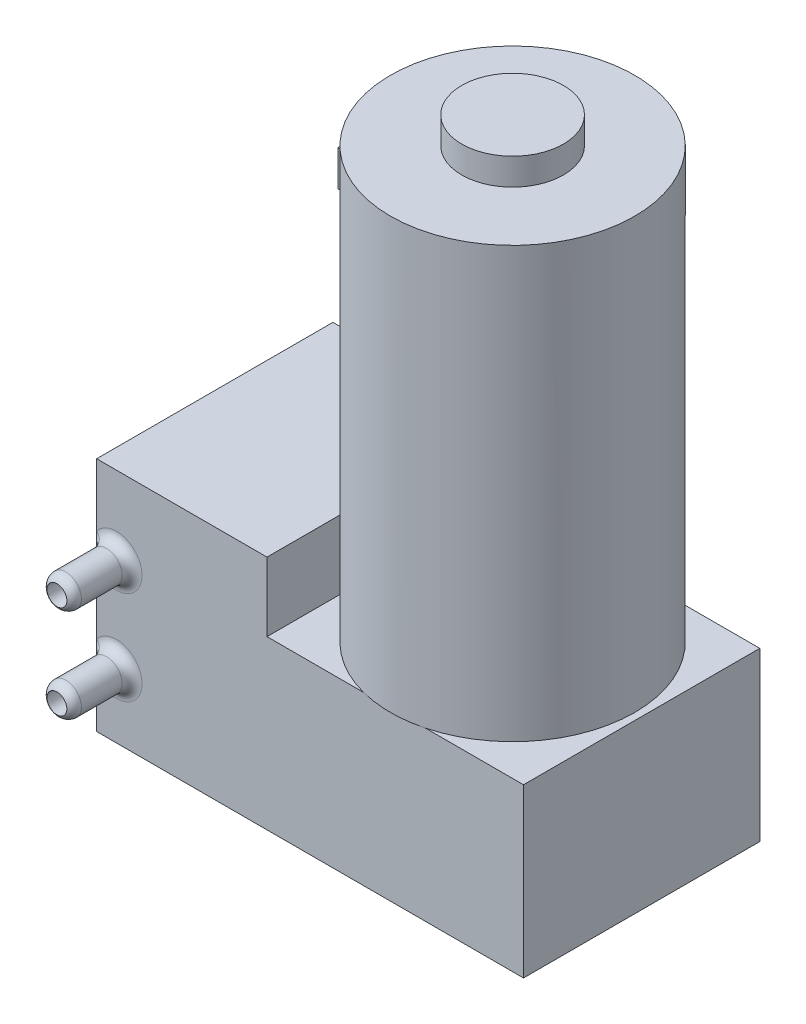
ISO-10303-21;
HEADER;
FILE_DESCRIPTION(('STEP AP214'),'2;1');
FILE_NAME('part.step','',(''),(''),'','','');
FILE_SCHEMA(('AUTOMOTIVE_DESIGN { 1 0 10303 214 1 1 1 1 }'));
ENDSEC;
DATA;
#1=APPLICATION_CONTEXT('core data for automotive mechanical design processes');
#2=APPLICATION_PROTOCOL_DEFINITION('international standard','automotive_design',2000,#1);
#3=PRODUCT_CONTEXT('',#1,'mechanical');
#4=PRODUCT('Part','Part','',(#3));
#5=PRODUCT_RELATED_PRODUCT_CATEGORY('part','',(#4));
#6=PRODUCT_DEFINITION_FORMATION('','',#4);
#7=PRODUCT_DEFINITION_CONTEXT('part definition',#1,'design');
#8=PRODUCT_DEFINITION('design','',#6,#7);
#9=PRODUCT_DEFINITION_SHAPE('','',#8);
#10=(LENGTH_UNIT() NAMED_UNIT(*) SI_UNIT(.MILLI.,.METRE.));
#11=(NAMED_UNIT(*) PLANE_ANGLE_UNIT() SI_UNIT($,.RADIAN.));
#12=(NAMED_UNIT(*) SI_UNIT($,.STERADIAN.) SOLID_ANGLE_UNIT());
#13=UNCERTAINTY_MEASURE_WITH_UNIT(LENGTH_MEASURE(1.E-05),#10,'distance_accuracy_value','');
#14=(GEOMETRIC_REPRESENTATION_CONTEXT(3) GLOBAL_UNCERTAINTY_ASSIGNED_CONTEXT((#13)) GLOBAL_UNIT_ASSIGNED_CONTEXT((#10,
#11,#12)) REPRESENTATION_CONTEXT('',''));
#15=CARTESIAN_POINT('',(0.,0.,0.));
#16=DIRECTION('',(0.,0.,1.));
#17=DIRECTION('',(1.,0.,0.));
#18=AXIS2_PLACEMENT_3D('',#15,#16,#17);
#19=CARTESIAN_POINT('',(38.1,76.4032,0.));
#20=DIRECTION('',(0.,-1.,0.));
#21=DIRECTION('',(0.,0.,-1.));
#22=AXIS2_PLACEMENT_3D('',#19,#20,#21);
#23=CYLINDRICAL_SURFACE('',#22,15.621);
#24=CARTESIAN_POINT('',(38.1,21.4122,0.));
#25=DIRECTION('',(0.,1.,0.));
#26=DIRECTION('',(0.,0.,1.));
#27=AXIS2_PLACEMENT_3D('',#24,#25,#26);
#28=CIRCLE('',#27,15.621);
#29=CARTESIAN_POINT('',(42.0513126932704,21.4122,15.113));
#30=VERTEX_POINT('',#29);
#31=CARTESIAN_POINT('',(42.0513126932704,21.4122,-15.113));
#32=VERTEX_POINT('',#31);
#33=EDGE_CURVE('E468',#30,#32,#28,.T.);
#34=ORIENTED_EDGE('',*,*,#33,.T.);
#35=CARTESIAN_POINT('',(34.1486873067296,21.4122,-15.113));
#36=VERTEX_POINT('',#35);
#37=EDGE_CURVE('E461',#32,#36,#28,.T.);
#38=ORIENTED_EDGE('',*,*,#37,.T.);
#39=CARTESIAN_POINT('',(34.1486873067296,21.4122,15.113));
#40=VERTEX_POINT('',#39);
#41=EDGE_CURVE('E467',#36,#40,#28,.T.);
#42=ORIENTED_EDGE('',*,*,#41,.T.);
#43=EDGE_CURVE('E471',#40,#30,#28,.T.);
#44=ORIENTED_EDGE('',*,*,#43,.T.);
#45=EDGE_LOOP('',(#34,#38,#42,#44));
#46=FACE_BOUND('',#45,.T.);
#47=CARTESIAN_POINT('',(38.1,76.4032,0.));
#48=DIRECTION('',(0.,1.,0.));
#49=DIRECTION('',(0.,0.,1.));
#50=AXIS2_PLACEMENT_3D('',#47,#48,#49);
#51=CIRCLE('',#50,15.621);
#52=CARTESIAN_POINT('',(38.1,76.4032,15.621));
#53=VERTEX_POINT('',#52);
#54=EDGE_CURVE('E470',#53,#53,#51,.T.);
#55=ORIENTED_EDGE('',*,*,#54,.F.);
#56=EDGE_LOOP('',(#55));
#57=FACE_BOUND('',#56,.T.);
#58=DIRECTION('',(0.,-1.,0.));
#59=VECTOR('',#58,1.);
#60=CARTESIAN_POINT('',(23.0169119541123,76.4032,4.064));
#61=LINE('',#60,#59);
#62=CARTESIAN_POINT('',(23.0169119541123,64.516,4.064));
#63=VERTEX_POINT('',#62);
#64=CARTESIAN_POINT('',(23.0169119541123,69.088,4.064));
#65=VERTEX_POINT('',#64);
#66=EDGE_CURVE('E11',#63,#65,#61,.F.);
#67=ORIENTED_EDGE('',*,*,#66,.F.);
#68=CARTESIAN_POINT('',(38.1,64.516,0.));
#69=DIRECTION('',(0.,1.,0.));
#70=DIRECTION('',(0.,0.,1.));
#71=AXIS2_PLACEMENT_3D('',#68,#69,#70);
#72=CIRCLE('',#71,15.621);
#73=CARTESIAN_POINT('',(22.8891320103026,64.516,-3.556));
#74=VERTEX_POINT('',#73);
#75=EDGE_CURVE('E39',#74,#63,#72,.T.);
#76=ORIENTED_EDGE('',*,*,#75,.F.);
#77=DIRECTION('',(0.,-1.,0.));
#78=VECTOR('',#77,1.);
#79=CARTESIAN_POINT('',(22.8891320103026,76.4032,-3.556));
#80=LINE('',#79,#78);
#81=CARTESIAN_POINT('',(22.8891320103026,69.088,-3.556));
#82=VERTEX_POINT('',#81);
#83=EDGE_CURVE('E796',#82,#74,#80,.T.);
#84=ORIENTED_EDGE('',*,*,#83,.F.);
#85=CARTESIAN_POINT('',(38.1,69.088,0.));
#86=DIRECTION('',(0.,-1.,0.));
#87=DIRECTION('',(0.,0.,-1.));
#88=AXIS2_PLACEMENT_3D('',#85,#86,#87);
#89=CIRCLE('',#88,15.621);
#90=EDGE_CURVE('E445',#65,#82,#89,.T.);
#91=ORIENTED_EDGE('',*,*,#90,.F.);
#92=EDGE_LOOP('',(#67,#76,#84,#91));
#93=FACE_BOUND('',#92,.T.);
#94=ADVANCED_FACE('F30',(#46,#57,#93),#23,.T.);
#95=CARTESIAN_POINT('',(38.1,76.4032,0.));
#96=DIRECTION('',(0.,1.,0.));
#97=DIRECTION('',(0.,0.,1.));
#98=AXIS2_PLACEMENT_3D('',#95,#96,#97);
#99=PLANE('',#98);
#100=ORIENTED_EDGE('',*,*,#54,.T.);
#101=EDGE_LOOP('',(#100));
#102=FACE_BOUND('',#101,.T.);
#103=CARTESIAN_POINT('',(38.1,76.4032,0.));
#104=DIRECTION('',(0.,1.,0.));
#105=DIRECTION('',(0.,0.,1.));
#106=AXIS2_PLACEMENT_3D('',#103,#104,#105);
#107=CIRCLE('',#106,6.5024);
#108=CARTESIAN_POINT('',(38.1,76.4032,6.5024));
#109=VERTEX_POINT('',#108);
#110=EDGE_CURVE('E152',#109,#109,#107,.T.);
#111=ORIENTED_EDGE('',*,*,#110,.F.);
#112=EDGE_LOOP('',(#111));
#113=FACE_BOUND('',#112,.T.);
#114=ADVANCED_FACE('F300',(#102,#113),#99,.T.);
#115=CARTESIAN_POINT('',(21.7932,21.4122,15.113));
#116=DIRECTION('',(0.,-1.,0.));
#117=DIRECTION('',(0.,0.,-1.));
#118=AXIS2_PLACEMENT_3D('',#115,#116,#117);
#119=PLANE('',#118);
#120=ORIENTED_EDGE('',*,*,#41,.F.);
#121=DIRECTION('',(-1.,0.,0.));
#122=VECTOR('',#121,1.);
#123=CARTESIAN_POINT('',(21.7932,21.4122,-15.113));
#124=LINE('',#123,#122);
#125=CARTESIAN_POINT('',(21.7932,21.4122,-15.113));
#126=VERTEX_POINT('',#125);
#127=EDGE_CURVE('E394',#36,#126,#124,.T.);
#128=ORIENTED_EDGE('',*,*,#127,.T.);
#129=DIRECTION('',(0.,0.,-1.));
#130=VECTOR('',#129,1.);
#131=CARTESIAN_POINT('',(21.7932,21.4122,15.113));
#132=LINE('',#131,#130);
#133=CARTESIAN_POINT('',(21.7932,21.4122,15.113));
#134=VERTEX_POINT('',#133);
#135=EDGE_CURVE('E355',#134,#126,#132,.T.);
#136=ORIENTED_EDGE('',*,*,#135,.F.);
#137=DIRECTION('',(-1.,0.,0.));
#138=VECTOR('',#137,1.);
#139=CARTESIAN_POINT('',(21.7932,21.4122,15.113));
#140=LINE('',#139,#138);
#141=EDGE_CURVE('E375',#40,#134,#140,.T.);
#142=ORIENTED_EDGE('',*,*,#141,.F.);
#143=EDGE_LOOP('',(#120,#128,#136,#142));
#144=FACE_BOUND('',#143,.T.);
#145=ADVANCED_FACE('F298',(#144),#119,.F.);
#146=ORIENTED_EDGE('',*,*,#33,.F.);
#147=CARTESIAN_POINT('',(54.61,21.4122,15.113));
#148=VERTEX_POINT('',#147);
#149=EDGE_CURVE('E372',#148,#30,#140,.T.);
#150=ORIENTED_EDGE('',*,*,#149,.F.);
#151=DIRECTION('',(0.,0.,-1.));
#152=VECTOR('',#151,1.);
#153=CARTESIAN_POINT('',(54.61,21.4122,15.113));
#154=LINE('',#153,#152);
#155=CARTESIAN_POINT('',(54.61,21.4122,-15.113));
#156=VERTEX_POINT('',#155);
#157=EDGE_CURVE('E353',#148,#156,#154,.T.);
#158=ORIENTED_EDGE('',*,*,#157,.T.);
#159=EDGE_CURVE('E390',#156,#32,#124,.T.);
#160=ORIENTED_EDGE('',*,*,#159,.T.);
#161=EDGE_LOOP('',(#146,#150,#158,#160));
#162=FACE_BOUND('',#161,.T.);
#163=ADVANCED_FACE('F292',(#162),#119,.F.);
#164=CARTESIAN_POINT('',(54.61,0.,15.113));
#165=DIRECTION('',(0.,1.,0.));
#166=DIRECTION('',(-1.,0.,0.));
#167=AXIS2_PLACEMENT_3D('',#164,#165,#166);
#168=PLANE('',#167);
#169=DIRECTION('',(0.,0.,-1.));
#170=VECTOR('',#169,1.);
#171=CARTESIAN_POINT('',(0.,0.,15.113));
#172=LINE('',#171,#170);
#173=CARTESIAN_POINT('',(0.,0.,15.113));
#174=VERTEX_POINT('',#173);
#175=CARTESIAN_POINT('',(0.,0.,-15.113));
#176=VERTEX_POINT('',#175);
#177=EDGE_CURVE('E361',#174,#176,#172,.T.);
#178=ORIENTED_EDGE('',*,*,#177,.T.);
#179=DIRECTION('',(1.,0.,0.));
#180=VECTOR('',#179,1.);
#181=CARTESIAN_POINT('',(54.61,0.,-15.113));
#182=LINE('',#181,#180);
#183=CARTESIAN_POINT('',(54.61,0.,-15.113));
#184=VERTEX_POINT('',#183);
#185=EDGE_CURVE('E397',#176,#184,#182,.T.);
#186=ORIENTED_EDGE('',*,*,#185,.T.);
#187=DIRECTION('',(0.,0.,-1.));
#188=VECTOR('',#187,1.);
#189=CARTESIAN_POINT('',(54.61,0.,15.113));
#190=LINE('',#189,#188);
#191=CARTESIAN_POINT('',(54.61,0.,15.113));
#192=VERTEX_POINT('',#191);
#193=EDGE_CURVE('E351',#192,#184,#190,.T.);
#194=ORIENTED_EDGE('',*,*,#193,.F.);
#195=DIRECTION('',(1.,0.,0.));
#196=VECTOR('',#195,1.);
#197=CARTESIAN_POINT('',(54.61,0.,15.113));
#198=LINE('',#197,#196);
#199=EDGE_CURVE('E378',#174,#192,#198,.T.);
#200=ORIENTED_EDGE('',*,*,#199,.F.);
#201=EDGE_LOOP('',(#178,#186,#194,#200));
#202=FACE_BOUND('',#201,.T.);
#203=ADVANCED_FACE('F288',(#202),#168,.F.);
#204=CARTESIAN_POINT('',(54.61,21.4122,15.113));
#205=DIRECTION('',(-1.,0.,0.));
#206=DIRECTION('',(0.,0.,1.));
#207=AXIS2_PLACEMENT_3D('',#204,#205,#206);
#208=PLANE('',#207);
#209=ORIENTED_EDGE('',*,*,#193,.T.);
#210=DIRECTION('',(0.,1.,0.));
#211=VECTOR('',#210,1.);
#212=CARTESIAN_POINT('',(54.61,21.4122,-15.113));
#213=LINE('',#212,#211);
#214=EDGE_CURVE('E395',#184,#156,#213,.T.);
#215=ORIENTED_EDGE('',*,*,#214,.T.);
#216=ORIENTED_EDGE('',*,*,#157,.F.);
#217=DIRECTION('',(0.,1.,0.));
#218=VECTOR('',#217,1.);
#219=CARTESIAN_POINT('',(54.61,21.4122,15.113));
#220=LINE('',#219,#218);
#221=EDGE_CURVE('E376',#192,#148,#220,.T.);
#222=ORIENTED_EDGE('',*,*,#221,.F.);
#223=EDGE_LOOP('',(#209,#215,#216,#222));
#224=FACE_BOUND('',#223,.T.);
#225=ADVANCED_FACE('F291',(#224),#208,.F.);
#226=CARTESIAN_POINT('',(21.7932,30.226,15.113));
#227=DIRECTION('',(-1.,0.,0.));
#228=DIRECTION('',(0.,0.,1.));
#229=AXIS2_PLACEMENT_3D('',#226,#227,#228);
#230=PLANE('',#229);
#231=ORIENTED_EDGE('',*,*,#135,.T.);
#232=DIRECTION('',(0.,1.,0.));
#233=VECTOR('',#232,1.);
#234=CARTESIAN_POINT('',(21.7932,30.226,-15.113));
#235=LINE('',#234,#233);
#236=CARTESIAN_POINT('',(21.7932,30.226,-15.113));
#237=VERTEX_POINT('',#236);
#238=EDGE_CURVE('E387',#126,#237,#235,.T.);
#239=ORIENTED_EDGE('',*,*,#238,.T.);
#240=DIRECTION('',(0.,0.,-1.));
#241=VECTOR('',#240,1.);
#242=CARTESIAN_POINT('',(21.7932,30.226,15.113));
#243=LINE('',#242,#241);
#244=CARTESIAN_POINT('',(21.7932,30.226,15.113));
#245=VERTEX_POINT('',#244);
#246=EDGE_CURVE('E357',#245,#237,#243,.T.);
#247=ORIENTED_EDGE('',*,*,#246,.F.);
#248=DIRECTION('',(0.,1.,0.));
#249=VECTOR('',#248,1.);
#250=CARTESIAN_POINT('',(21.7932,30.226,15.113));
#251=LINE('',#250,#249);
#252=EDGE_CURVE('E370',#134,#245,#251,.T.);
#253=ORIENTED_EDGE('',*,*,#252,.F.);
#254=EDGE_LOOP('',(#231,#239,#247,#253));
#255=FACE_BOUND('',#254,.T.);
#256=ADVANCED_FACE('F296',(#255),#230,.F.);
#257=CARTESIAN_POINT('',(0.,30.226,15.113));
#258=DIRECTION('',(0.,-1.,0.));
#259=DIRECTION('',(0.,0.,-1.));
#260=AXIS2_PLACEMENT_3D('',#257,#258,#259);
#261=PLANE('',#260);
#262=ORIENTED_EDGE('',*,*,#246,.T.);
#263=DIRECTION('',(-1.,0.,0.));
#264=VECTOR('',#263,1.);
#265=CARTESIAN_POINT('',(0.,30.226,-15.113));
#266=LINE('',#265,#264);
#267=CARTESIAN_POINT('',(0.,30.226,-15.113));
#268=VERTEX_POINT('',#267);
#269=EDGE_CURVE('E384',#237,#268,#266,.T.);
#270=ORIENTED_EDGE('',*,*,#269,.T.);
#271=DIRECTION('',(0.,0.,-1.));
#272=VECTOR('',#271,1.);
#273=CARTESIAN_POINT('',(0.,30.226,15.113));
#274=LINE('',#273,#272);
#275=CARTESIAN_POINT('',(0.,30.226,15.113));
#276=VERTEX_POINT('',#275);
#277=EDGE_CURVE('E359',#276,#268,#274,.T.);
#278=ORIENTED_EDGE('',*,*,#277,.F.);
#279=DIRECTION('',(-1.,0.,0.));
#280=VECTOR('',#279,1.);
#281=CARTESIAN_POINT('',(0.,30.226,15.113));
#282=LINE('',#281,#280);
#283=EDGE_CURVE('E368',#245,#276,#282,.T.);
#284=ORIENTED_EDGE('',*,*,#283,.F.);
#285=EDGE_LOOP('',(#262,#270,#278,#284));
#286=FACE_BOUND('',#285,.T.);
#287=ADVANCED_FACE('F236',(#286),#261,.F.);
#288=CARTESIAN_POINT('',(0.,0.,15.113));
#289=DIRECTION('',(1.,0.,0.));
#290=DIRECTION('',(0.,0.,-1.));
#291=AXIS2_PLACEMENT_3D('',#288,#289,#290);
#292=PLANE('',#291);
#293=ORIENTED_EDGE('',*,*,#277,.T.);
#294=DIRECTION('',(0.,-1.,0.));
#295=VECTOR('',#294,1.);
#296=CARTESIAN_POINT('',(0.,0.,-15.113));
#297=LINE('',#296,#295);
#298=EDGE_CURVE('E381',#268,#176,#297,.T.);
#299=ORIENTED_EDGE('',*,*,#298,.T.);
#300=ORIENTED_EDGE('',*,*,#177,.F.);
#301=DIRECTION('',(0.,-1.,0.));
#302=VECTOR('',#301,1.);
#303=CARTESIAN_POINT('',(0.,0.,15.113));
#304=LINE('',#303,#302);
#305=CARTESIAN_POINT('',(0.,6.15445776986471,15.113));
#306=VERTEX_POINT('',#305);
#307=EDGE_CURVE('E367',#306,#174,#304,.T.);
#308=ORIENTED_EDGE('',*,*,#307,.F.);
#309=CARTESIAN_POINT('',(0.,10.2539422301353,15.113));
#310=VERTEX_POINT('',#309);
#311=EDGE_CURVE('E482',#310,#306,#304,.T.);
#312=ORIENTED_EDGE('',*,*,#311,.F.);
#313=CARTESIAN_POINT('',(0.,18.1432577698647,15.113));
#314=VERTEX_POINT('',#313);
#315=EDGE_CURVE('E479',#314,#310,#304,.T.);
#316=ORIENTED_EDGE('',*,*,#315,.F.);
#317=CARTESIAN_POINT('',(0.,22.2427422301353,15.113));
#318=VERTEX_POINT('',#317);
#319=EDGE_CURVE('E366',#318,#314,#304,.T.);
#320=ORIENTED_EDGE('',*,*,#319,.F.);
#321=EDGE_CURVE('E363',#276,#318,#304,.T.);
#322=ORIENTED_EDGE('',*,*,#321,.F.);
#323=EDGE_LOOP('',(#293,#299,#300,#308,#312,#316,#320,#322));
#324=FACE_BOUND('',#323,.T.);
#325=ADVANCED_FACE('F232',(#324),#292,.F.);
#326=CARTESIAN_POINT('',(0.,0.,15.113));
#327=DIRECTION('',(0.,0.,-1.));
#328=DIRECTION('',(-1.,0.,0.));
#329=AXIS2_PLACEMENT_3D('',#326,#327,#328);
#330=PLANE('',#329);
#331=ORIENTED_EDGE('',*,*,#315,.T.);
#332=CARTESIAN_POINT('',(2.54,8.2042,15.113));
#333=DIRECTION('',(0.,0.,-1.));
#334=DIRECTION('',(-1.,0.,0.));
#335=AXIS2_PLACEMENT_3D('',#332,#333,#334);
#336=CIRCLE('',#335,3.2639);
#337=EDGE_CURVE('E428',#310,#306,#336,.T.);
#338=ORIENTED_EDGE('',*,*,#337,.T.);
#339=ORIENTED_EDGE('',*,*,#307,.T.);
#340=ORIENTED_EDGE('',*,*,#199,.T.);
#341=ORIENTED_EDGE('',*,*,#221,.T.);
#342=ORIENTED_EDGE('',*,*,#149,.T.);
#343=DIRECTION('',(1.,0.,0.));
#344=VECTOR('',#343,1.);
#345=CARTESIAN_POINT('',(0.,21.4122,15.113));
#346=LINE('',#345,#344);
#347=EDGE_CURVE('E475',#40,#30,#346,.T.);
#348=ORIENTED_EDGE('',*,*,#347,.F.);
#349=ORIENTED_EDGE('',*,*,#141,.T.);
#350=ORIENTED_EDGE('',*,*,#252,.T.);
#351=ORIENTED_EDGE('',*,*,#283,.T.);
#352=ORIENTED_EDGE('',*,*,#321,.T.);
#353=CARTESIAN_POINT('',(2.54,20.193,15.113));
#354=DIRECTION('',(0.,0.,-1.));
#355=DIRECTION('',(-1.,0.,0.));
#356=AXIS2_PLACEMENT_3D('',#353,#354,#355);
#357=CIRCLE('',#356,3.2639);
#358=EDGE_CURVE('E339',#318,#314,#357,.T.);
#359=ORIENTED_EDGE('',*,*,#358,.T.);
#360=EDGE_LOOP('',(#331,#338,#339,#340,#341,#342,#348,#349,#350,#351,#352,#359));
#361=FACE_BOUND('',#360,.T.);
#362=ADVANCED_FACE('F229',(#361),#330,.F.);
#363=CARTESIAN_POINT('',(0.,0.,-15.113));
#364=DIRECTION('',(0.,0.,-1.));
#365=DIRECTION('',(-1.,0.,0.));
#366=AXIS2_PLACEMENT_3D('',#363,#364,#365);
#367=PLANE('',#366);
#368=CARTESIAN_POINT('',(24.638,6.35,-15.113));
#369=DIRECTION('',(0.,0.,-1.));
#370=DIRECTION('',(-1.,0.,0.));
#371=AXIS2_PLACEMENT_3D('',#368,#369,#370);
#372=CIRCLE('',#371,2.0828);
#373=CARTESIAN_POINT('',(22.5552,6.35,-15.113));
#374=VERTEX_POINT('',#373);
#375=EDGE_CURVE('E191',#374,#374,#372,.T.);
#376=ORIENTED_EDGE('',*,*,#375,.F.);
#377=EDGE_LOOP('',(#376));
#378=FACE_BOUND('',#377,.T.);
#379=CARTESIAN_POINT('',(49.2203844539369,10.8651318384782,-15.113));
#380=DIRECTION('',(0.,0.,-1.));
#381=DIRECTION('',(-1.,0.,0.));
#382=AXIS2_PLACEMENT_3D('',#379,#380,#381);
#383=CIRCLE('',#382,2.0828);
#384=CARTESIAN_POINT('',(47.1375844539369,10.8651318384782,-15.113));
#385=VERTEX_POINT('',#384);
#386=EDGE_CURVE('E203',#385,#385,#383,.T.);
#387=ORIENTED_EDGE('',*,*,#386,.F.);
#388=EDGE_LOOP('',(#387));
#389=FACE_BOUND('',#388,.T.);
#390=ORIENTED_EDGE('',*,*,#185,.F.);
#391=ORIENTED_EDGE('',*,*,#298,.F.);
#392=ORIENTED_EDGE('',*,*,#269,.F.);
#393=ORIENTED_EDGE('',*,*,#238,.F.);
#394=ORIENTED_EDGE('',*,*,#127,.F.);
#395=EDGE_CURVE('E393',#32,#36,#124,.T.);
#396=ORIENTED_EDGE('',*,*,#395,.F.);
#397=ORIENTED_EDGE('',*,*,#159,.F.);
#398=ORIENTED_EDGE('',*,*,#214,.F.);
#399=EDGE_LOOP('',(#390,#391,#392,#393,#394,#396,#397,#398));
#400=FACE_BOUND('',#399,.T.);
#401=ADVANCED_FACE('F272',(#378,#389,#400),#367,.T.);
#402=CARTESIAN_POINT('',(2.54,20.193,22.733));
#403=DIRECTION('',(0.,0.,-1.));
#404=DIRECTION('',(-1.,0.,0.));
#405=AXIS2_PLACEMENT_3D('',#402,#403,#404);
#406=CYLINDRICAL_SURFACE('',#405,1.9939);
#407=CARTESIAN_POINT('',(2.54,20.193,16.383));
#408=DIRECTION('',(0.,0.,-1.));
#409=DIRECTION('',(-1.,0.,0.));
#410=AXIS2_PLACEMENT_3D('',#407,#408,#409);
#411=CIRCLE('',#410,1.9939);
#412=CARTESIAN_POINT('',(0.988326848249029,18.9408228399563,16.383));
#413=VERTEX_POINT('',#412);
#414=CARTESIAN_POINT('',(0.988326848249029,21.4451771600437,16.383));
#415=VERTEX_POINT('',#414);
#416=EDGE_CURVE('E283',#413,#415,#411,.F.);
#417=ORIENTED_EDGE('',*,*,#416,.T.);
#418=CARTESIAN_POINT('',(1.28147851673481,21.7395318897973,16.288849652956));
#419=CARTESIAN_POINT('',(0.902369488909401,21.4310242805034,14.744736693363));
#420=CARTESIAN_POINT('',(0.,22.7245840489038,15.113));
#421=CARTESIAN_POINT('',(1.25904878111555,21.7212868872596,16.3038320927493));
#422=CARTESIAN_POINT('',(0.924733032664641,21.4401361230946,14.7682026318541));
#423=CARTESIAN_POINT('',(0.,22.6947180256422,15.113));
#424=CARTESIAN_POINT('',(1.23673595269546,21.7023105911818,16.3167349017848));
#425=CARTESIAN_POINT('',(0.943279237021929,21.4480937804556,14.793848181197));
#426=CARTESIAN_POINT('',(0.,22.6636549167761,15.113));
#427=CARTESIAN_POINT('',(1.1926266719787,21.6630635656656,16.3387572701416));
#428=CARTESIAN_POINT('',(0.972628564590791,21.4606110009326,14.8471448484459));
#429=CARTESIAN_POINT('',(0.,22.5994097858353,15.113));
#430=CARTESIAN_POINT('',(1.17082937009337,21.6427952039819,16.3478835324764));
#431=CARTESIAN_POINT('',(0.983572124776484,21.4652324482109,14.8747171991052));
#432=CARTESIAN_POINT('',(0.,22.5662316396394,15.113));
#433=CARTESIAN_POINT('',(1.10698142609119,21.5806572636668,16.3700647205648));
#434=CARTESIAN_POINT('',(1.00543306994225,21.4728580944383,14.9563683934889));
#435=CARTESIAN_POINT('',(0.,22.4645153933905,15.113));
#436=CARTESIAN_POINT('',(1.06597549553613,21.5370510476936,16.3782304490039));
#437=CARTESIAN_POINT('',(1.00703749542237,21.4704526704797,15.0114145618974));
#438=CARTESIAN_POINT('',(0.,22.393134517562,15.113));
#439=CARTESIAN_POINT('',(0.970056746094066,21.4252966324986,16.3860829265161));
#440=CARTESIAN_POINT('',(0.988014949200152,21.4433371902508,15.1352115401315));
#441=CARTESIAN_POINT('',(0.,22.2101989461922,15.113));
#442=CARTESIAN_POINT('',(0.917422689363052,21.3550855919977,16.3801420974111));
#443=CARTESIAN_POINT('',(0.958375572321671,21.4101909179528,15.2010624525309));
#444=CARTESIAN_POINT('',(0.,22.0952674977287,15.113));
#445=CARTESIAN_POINT('',(0.821920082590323,21.208656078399,16.3559765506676));
#446=CARTESIAN_POINT('',(0.885445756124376,21.3134504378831,15.307407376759));
#447=CARTESIAN_POINT('',(0.,21.8555707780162,15.113));
#448=CARTESIAN_POINT('',(0.779111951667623,21.1324041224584,16.337678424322));
#449=CARTESIAN_POINT('',(0.842480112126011,21.250796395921,15.3492959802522));
#450=CARTESIAN_POINT('',(0.,21.7307506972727,15.113));
#451=CARTESIAN_POINT('',(0.701987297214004,20.9712930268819,16.295305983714));
#452=CARTESIAN_POINT('',(0.75714260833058,21.1006622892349,15.4139553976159));
#453=CARTESIAN_POINT('',(0.,21.4670210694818,15.113));
#454=CARTESIAN_POINT('',(0.668232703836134,20.8861922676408,16.2709794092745));
#455=CARTESIAN_POINT('',(0.714314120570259,21.0120790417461,15.4368558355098));
#456=CARTESIAN_POINT('',(0.,21.3277160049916,15.113));
#457=CARTESIAN_POINT('',(0.612670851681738,20.7120020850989,16.2253729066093));
#458=CARTESIAN_POINT('',(0.641358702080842,20.8199309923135,15.4682445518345));
#459=CARTESIAN_POINT('',(0.,21.042576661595,15.113));
#460=CARTESIAN_POINT('',(0.590839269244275,20.6229211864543,16.2040868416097));
#461=CARTESIAN_POINT('',(0.610461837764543,20.7157680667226,15.4773282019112));
#462=CARTESIAN_POINT('',(0.,20.896756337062,15.113));
#463=CARTESIAN_POINT('',(0.567127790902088,20.4856904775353,16.1796549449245));
#464=CARTESIAN_POINT('',(0.576622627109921,20.5512356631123,15.4858070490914));
#465=CARTESIAN_POINT('',(0.,20.6721175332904,15.113));
#466=CARTESIAN_POINT('',(0.560704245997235,20.4385504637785,16.1727130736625));
#467=CARTESIAN_POINT('',(0.567337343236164,20.4940943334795,15.4877841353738));
#468=CARTESIAN_POINT('',(0.,20.5949520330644,15.113));
#469=CARTESIAN_POINT('',(0.55123952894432,20.3437810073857,16.1623186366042));
#470=CARTESIAN_POINT('',(0.553633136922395,20.378560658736,15.4905289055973));
#471=CARTESIAN_POINT('',(0.,20.4398198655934,15.113));
#472=CARTESIAN_POINT('',(0.548198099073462,20.2961516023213,16.1588658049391));
#473=CARTESIAN_POINT('',(0.5491677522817,20.3199800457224,15.4913070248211));
#474=CARTESIAN_POINT('',(0.,20.3618532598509,15.113));
#475=CARTESIAN_POINT('',(0.545545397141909,20.200789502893,16.1558622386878));
#476=CARTESIAN_POINT('',(0.545291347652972,20.2026590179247,15.4919901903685));
#477=CARTESIAN_POINT('',(0.,20.2057509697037,15.113));
#478=CARTESIAN_POINT('',(0.545931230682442,20.1530569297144,16.1563082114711));
#479=CARTESIAN_POINT('',(0.545862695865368,20.1437176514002,15.4918983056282));
#480=CARTESIAN_POINT('',(0.,20.1276154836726,15.113));
#481=CARTESIAN_POINT('',(0.550115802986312,20.0578213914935,16.1610239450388));
#482=CARTESIAN_POINT('',(0.551964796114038,20.0266787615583,15.4908009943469));
#483=CARTESIAN_POINT('',(0.,19.9717203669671,15.113));
#484=CARTESIAN_POINT('',(0.553914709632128,20.0103184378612,16.1652938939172));
#485=CARTESIAN_POINT('',(0.557516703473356,19.9683822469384,15.489791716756));
#486=CARTESIAN_POINT('',(0.,19.8939607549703,15.113));
#487=CARTESIAN_POINT('',(0.570301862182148,19.8692102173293,16.1831190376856));
#488=CARTESIAN_POINT('',(0.581276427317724,19.7965268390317,15.4848473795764));
#489=CARTESIAN_POINT('',(0.,19.6629746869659,15.113));
#490=CARTESIAN_POINT('',(0.587864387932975,19.7763770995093,16.2016791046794));
#491=CARTESIAN_POINT('',(0.606779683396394,19.6850541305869,15.4789524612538));
#492=CARTESIAN_POINT('',(0.,19.5110121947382,15.113));
#493=CARTESIAN_POINT('',(0.635741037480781,19.594354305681,16.2451446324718));
#494=CARTESIAN_POINT('',(0.671996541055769,19.4765926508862,15.4561324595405));
#495=CARTESIAN_POINT('',(0.,19.2130513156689,15.113));
#496=CARTESIAN_POINT('',(0.666113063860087,19.5051832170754,16.2700787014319));
#497=CARTESIAN_POINT('',(0.712539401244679,19.3787370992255,15.4387368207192));
#498=CARTESIAN_POINT('',(0.,19.0670833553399,15.113));
#499=CARTESIAN_POINT('',(0.744974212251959,19.3181813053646,16.3212122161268));
#500=CARTESIAN_POINT('',(0.806938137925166,19.1908421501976,15.3800631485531));
#501=CARTESIAN_POINT('',(0.,18.7609719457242,15.113));
#502=CARTESIAN_POINT('',(0.795542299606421,19.2211516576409,16.3470083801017));
#503=CARTESIAN_POINT('',(0.862659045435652,19.1047880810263,15.3341247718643));
#504=CARTESIAN_POINT('',(0.,18.6021399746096,15.113));
#505=CARTESIAN_POINT('',(0.883018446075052,19.082591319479,16.3721651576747));
#506=CARTESIAN_POINT('',(0.932540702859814,19.0093707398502,15.2408753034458));
#507=CARTESIAN_POINT('',(0.,18.3753246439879,15.113));
#508=CARTESIAN_POINT('',(0.913979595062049,19.0377208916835,16.3782964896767));
#509=CARTESIAN_POINT('',(0.953929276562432,18.9828459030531,15.2046996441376));
#510=CARTESIAN_POINT('',(0.,18.3018743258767,15.113));
#511=CARTESIAN_POINT('',(0.979544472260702,18.9505885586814,16.3840557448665));
#512=CARTESIAN_POINT('',(0.987323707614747,18.9420931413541,15.1240819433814));
#513=CARTESIAN_POINT('',(0.,18.1592436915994,15.113));
#514=CARTESIAN_POINT('',(1.01414407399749,18.9083237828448,16.3836909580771));
#515=CARTESIAN_POINT('',(0.999043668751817,18.9282422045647,15.0793042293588));
#516=CARTESIAN_POINT('',(0.,18.0900586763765,15.113));
#517=CARTESIAN_POINT('',(1.08663620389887,18.8268652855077,16.3741689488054));
#518=CARTESIAN_POINT('',(1.00637826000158,18.9140125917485,14.984072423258));
#519=CARTESIAN_POINT('',(0.,17.956715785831,15.113));
#520=CARTESIAN_POINT('',(1.12453533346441,18.7876780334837,16.3649937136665));
#521=CARTESIAN_POINT('',(1.00136157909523,18.9141641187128,14.9334212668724));
#522=CARTESIAN_POINT('',(0.,17.8925685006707,15.113));
#523=CARTESIAN_POINT('',(1.20290433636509,18.712847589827,16.335248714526));
#524=CARTESIAN_POINT('',(0.969277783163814,18.9263960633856,14.8332986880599));
#525=CARTESIAN_POINT('',(0.,17.770075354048,15.113));
#526=CARTESIAN_POINT('',(1.24339800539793,18.6772483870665,16.3145540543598));
#527=CARTESIAN_POINT('',(0.941190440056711,18.9390391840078,14.7840960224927));
#528=CARTESIAN_POINT('',(0.,17.7118014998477,15.113));
#529=CARTESIAN_POINT('',(1.28442094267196,18.6440782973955,16.2868724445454));
#530=CARTESIAN_POINT('',(0.899396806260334,18.9561846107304,14.7416412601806));
#531=CARTESIAN_POINT('',(0.,17.6575039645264,15.113));
#532=(BOUNDED_SURFACE() B_SPLINE_SURFACE(3,2,((#418,#419,#420),(#421,#422,#423),(#424,#425,
#426),(#427,#428,#429),(#430,#431,#432),(#433,#434,#435),(#436,#437,#438),(#439,#440,#441),
(#442,#443,#444),(#445,#446,#447),(#448,#449,#450),(#451,#452,#453),(#454,#455,#456),(#457,#458,
#459),(#460,#461,#462),(#463,#464,#465),(#466,#467,#468),(#469,#470,#471),(#472,#473,#474),
(#475,#476,#477),(#478,#479,#480),(#481,#482,#483),(#484,#485,#486),(#487,#488,#489),(#490,#491,
#492),(#493,#494,#495),(#496,#497,#498),(#499,#500,#501),(#502,#503,#504),(#505,#506,#507),
(#508,#509,#510),(#511,#512,#513),(#514,#515,#516),(#517,#518,#519),(#520,#521,#522),(#523,#524,
#525),(#526,#527,#528),(#529,#530,#531)),.UNSPECIFIED.,.F.,.F.,
.F.) B_SPLINE_SURFACE_WITH_KNOTS((4,2,2,2,2,2,2,2,2,2,2,2,2,2,2,2,2,2,4),(3,3),(0.,
0.148797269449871,0.297329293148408,0.591150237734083,1.0201174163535,1.45165556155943,
1.90578731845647,2.3589891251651,2.5933153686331,2.82762375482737,3.06173428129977,
3.29585632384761,3.76105302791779,4.22837548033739,4.76815995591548,5.03608901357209,
5.30371741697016,5.57189414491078,5.84303678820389),(0.,1.),
.UNSPECIFIED.) GEOMETRIC_REPRESENTATION_ITEM() RATIONAL_B_SPLINE_SURFACE(((1.,0.61705143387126,
1.),(1.,0.622719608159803,1.),(1.,0.628681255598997,1.),(1.,0.641022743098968,1.),(1.,
0.647401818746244,1.),(1.,0.666802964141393,1.),(1.,0.680219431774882,1.),(1.,0.713160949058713,
1.),(1.,0.732657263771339,1.),(1.,0.769421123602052,1.),(1.,0.786674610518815,1.),(1.,
0.818455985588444,1.),(1.,0.832793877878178,1.),(1.,0.856684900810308,1.),(1.,0.866247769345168,
1.),(1.,0.876686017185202,1.),(1.,0.879526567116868,1.),(1.,0.883718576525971,1.),(1.,
0.885070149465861,1.),(1.,0.886248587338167,1.),(1.,0.886076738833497,1.),(1.,0.8842188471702,
1.),(1.,0.882532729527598,1.),(1.,0.875279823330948,1.),(1.,0.867525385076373,1.),(1.,
0.846721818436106,1.),(1.,0.833648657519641,1.),(1.,0.800571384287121,1.),(1.,0.779806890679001,
1.),(1.,0.745828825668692,1.),(1.,0.734079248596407,1.),(1.,0.710087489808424,1.),(1.,
0.697845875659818,1.),(1.,0.673457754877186,1.),(1.,0.661311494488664,1.),(1.,0.637885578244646,
1.),(1.,0.626616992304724,1.),(1.,0.616309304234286,1.))) REPRESENTATION_ITEM('') SURFACE());
#533=CARTESIAN_POINT('',(1.28147851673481,21.7395318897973,16.288849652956));
#534=CARTESIAN_POINT('',(1.25904878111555,21.7212868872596,16.3038320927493));
#535=CARTESIAN_POINT('',(1.23673595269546,21.7023105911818,16.3167349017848));
#536=CARTESIAN_POINT('',(1.1926266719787,21.6630635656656,16.3387572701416));
#537=CARTESIAN_POINT('',(1.17082937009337,21.6427952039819,16.3478835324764));
#538=CARTESIAN_POINT('',(1.10698142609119,21.5806572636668,16.3700647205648));
#539=CARTESIAN_POINT('',(1.06597549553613,21.5370510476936,16.3782304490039));
#540=CARTESIAN_POINT('',(0.970056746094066,21.4252966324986,16.3860829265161));
#541=CARTESIAN_POINT('',(0.917422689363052,21.3550855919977,16.3801420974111));
#542=CARTESIAN_POINT('',(0.821920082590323,21.208656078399,16.3559765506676));
#543=CARTESIAN_POINT('',(0.779111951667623,21.1324041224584,16.337678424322));
#544=CARTESIAN_POINT('',(0.701987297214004,20.9712930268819,16.295305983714));
#545=CARTESIAN_POINT('',(0.668232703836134,20.8861922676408,16.2709794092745));
#546=CARTESIAN_POINT('',(0.612670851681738,20.7120020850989,16.2253729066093));
#547=CARTESIAN_POINT('',(0.590839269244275,20.6229211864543,16.2040868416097));
#548=CARTESIAN_POINT('',(0.567127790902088,20.4856904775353,16.1796549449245));
#549=CARTESIAN_POINT('',(0.560704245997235,20.4385504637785,16.1727130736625));
#550=CARTESIAN_POINT('',(0.55123952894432,20.3437810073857,16.1623186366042));
#551=CARTESIAN_POINT('',(0.548198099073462,20.2961516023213,16.1588658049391));
#552=CARTESIAN_POINT('',(0.545545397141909,20.200789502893,16.1558622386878));
#553=CARTESIAN_POINT('',(0.545931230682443,20.1530569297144,16.1563082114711));
#554=CARTESIAN_POINT('',(0.550115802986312,20.0578213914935,16.1610239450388));
#555=CARTESIAN_POINT('',(0.553914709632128,20.0103184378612,16.1652938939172));
#556=CARTESIAN_POINT('',(0.570301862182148,19.8692102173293,16.1831190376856));
#557=CARTESIAN_POINT('',(0.587864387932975,19.7763770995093,16.2016791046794));
#558=CARTESIAN_POINT('',(0.635741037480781,19.594354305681,16.2451446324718));
#559=CARTESIAN_POINT('',(0.666113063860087,19.5051832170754,16.2700787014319));
#560=CARTESIAN_POINT('',(0.744974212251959,19.3181813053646,16.3212122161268));
#561=CARTESIAN_POINT('',(0.795542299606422,19.2211516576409,16.3470083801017));
#562=CARTESIAN_POINT('',(0.883018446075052,19.082591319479,16.3721651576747));
#563=CARTESIAN_POINT('',(0.913979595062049,19.0377208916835,16.3782964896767));
#564=CARTESIAN_POINT('',(0.979544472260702,18.9505885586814,16.3840557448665));
#565=CARTESIAN_POINT('',(1.01414407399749,18.9083237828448,16.3836909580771));
#566=CARTESIAN_POINT('',(1.08663620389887,18.8268652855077,16.3741689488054));
#567=CARTESIAN_POINT('',(1.12453533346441,18.7876780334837,16.3649937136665));
#568=CARTESIAN_POINT('',(1.20290433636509,18.712847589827,16.335248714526));
#569=CARTESIAN_POINT('',(1.24339800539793,18.6772483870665,16.3145540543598));
#570=CARTESIAN_POINT('',(1.28442094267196,18.6440782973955,16.2868724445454));
#571=B_SPLINE_CURVE_WITH_KNOTS('',3,(#533,#534,#535,#536,#537,#538,#539,#540,#541,#542,#543,
#544,#545,#546,#547,#548,#549,#550,#551,#552,#553,#554,#555,#556,#557,#558,#559,#560,#561,#562,
#563,#564,#565,#566,#567,#568,#569,#570),.UNSPECIFIED.,.F.,.F.,(4,2,2,2,2,2,2,2,2,2,2,2,2,2,2,2,
2,2,4),(0.,0.148797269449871,0.297329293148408,0.591150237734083,1.0201174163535,
1.45165556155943,1.90578731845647,2.3589891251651,2.5933153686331,2.82762375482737,
3.06173428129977,3.29585632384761,3.76105302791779,4.22837548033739,4.76815995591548,
5.03608901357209,5.30371741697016,5.57189414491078,5.84303678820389),.UNSPECIFIED.);
#572=EDGE_CURVE('E276',#415,#413,#571,.T.);
#573=ORIENTED_EDGE('',*,*,#572,.T.);
#574=EDGE_LOOP('',(#417,#573));
#575=FACE_BOUND('',#574,.T.);
#576=CARTESIAN_POINT('',(2.54,20.193,21.5864073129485));
#577=DIRECTION('',(0.,0.,1.));
#578=DIRECTION('',(1.,0.,0.));
#579=AXIS2_PLACEMENT_3D('',#576,#577,#578);
#580=CIRCLE('',#579,1.9939);
#581=CARTESIAN_POINT('',(4.5339,20.193,21.5864073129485));
#582=VERTEX_POINT('',#581);
#583=EDGE_CURVE('E343',#582,#582,#580,.F.);
#584=ORIENTED_EDGE('',*,*,#583,.T.);
#585=EDGE_LOOP('',(#584));
#586=FACE_BOUND('',#585,.T.);
#587=ADVANCED_FACE('F268',(#575,#586),#406,.T.);
#588=CARTESIAN_POINT('',(2.54,20.193,22.733));
#589=DIRECTION('',(0.,0.,-1.));
#590=DIRECTION('',(-1.,0.,0.));
#591=AXIS2_PLACEMENT_3D('',#588,#589,#590);
#592=CYLINDRICAL_SURFACE('',#591,1.27);
#593=CARTESIAN_POINT('',(2.54,20.193,22.733));
#594=DIRECTION('',(0.,0.,-1.));
#595=DIRECTION('',(-1.,0.,0.));
#596=AXIS2_PLACEMENT_3D('',#593,#594,#595);
#597=CIRCLE('',#596,1.27);
#598=CARTESIAN_POINT('',(1.27,20.193,22.733));
#599=VERTEX_POINT('',#598);
#600=EDGE_CURVE('E261',#599,#599,#597,.T.);
#601=CARTESIAN_POINT('',(2.54,20.193,15.113));
#602=DIRECTION('',(0.,0.,-1.));
#603=DIRECTION('',(-1.,0.,0.));
#604=AXIS2_PLACEMENT_3D('',#601,#602,#603);
#605=CIRCLE('',#604,1.27);
#606=CARTESIAN_POINT('',(1.27,20.193,15.113));
#607=VERTEX_POINT('',#606);
#608=EDGE_CURVE('E346',#607,#607,#605,.T.);
#609=CARTESIAN_POINT('',(1.27,20.193,22.733));
#610=CARTESIAN_POINT('',(1.27,20.193,22.653625));
#611=CARTESIAN_POINT('',(1.27,20.193,22.57425));
#612=CARTESIAN_POINT('',(1.27,20.193,22.4155));
#613=CARTESIAN_POINT('',(1.27,20.193,22.336125));
#614=CARTESIAN_POINT('',(1.27,20.193,22.177375));
#615=CARTESIAN_POINT('',(1.27,20.193,22.098));
#616=CARTESIAN_POINT('',(1.27,20.193,21.93925));
#617=CARTESIAN_POINT('',(1.27,20.193,21.859875));
#618=CARTESIAN_POINT('',(1.27,20.193,21.701125));
#619=CARTESIAN_POINT('',(1.27,20.193,21.62175));
#620=CARTESIAN_POINT('',(1.27,20.193,21.463));
#621=CARTESIAN_POINT('',(1.27,20.193,21.383625));
#622=CARTESIAN_POINT('',(1.27,20.193,21.224875));
#623=CARTESIAN_POINT('',(1.27,20.193,21.1455));
#624=CARTESIAN_POINT('',(1.27,20.193,20.98675));
#625=CARTESIAN_POINT('',(1.27,20.193,20.907375));
#626=CARTESIAN_POINT('',(1.27,20.193,20.748625));
#627=CARTESIAN_POINT('',(1.27,20.193,20.66925));
#628=CARTESIAN_POINT('',(1.27,20.193,20.5105));
#629=CARTESIAN_POINT('',(1.27,20.193,20.431125));
#630=CARTESIAN_POINT('',(1.27,20.193,20.272375));
#631=CARTESIAN_POINT('',(1.27,20.193,20.193));
#632=CARTESIAN_POINT('',(1.27,20.193,20.03425));
#633=CARTESIAN_POINT('',(1.27,20.193,19.954875));
#634=CARTESIAN_POINT('',(1.27,20.193,19.796125));
#635=CARTESIAN_POINT('',(1.27,20.193,19.71675));
#636=CARTESIAN_POINT('',(1.27,20.193,19.558));
#637=CARTESIAN_POINT('',(1.27,20.193,19.478625));
#638=CARTESIAN_POINT('',(1.27,20.193,19.319875));
#639=CARTESIAN_POINT('',(1.27,20.193,19.2405));
#640=CARTESIAN_POINT('',(1.27,20.193,19.08175));
#641=CARTESIAN_POINT('',(1.27,20.193,19.002375));
#642=CARTESIAN_POINT('',(1.27,20.193,18.843625));
#643=CARTESIAN_POINT('',(1.27,20.193,18.76425));
#644=CARTESIAN_POINT('',(1.27,20.193,18.6055));
#645=CARTESIAN_POINT('',(1.27,20.193,18.526125));
#646=CARTESIAN_POINT('',(1.27,20.193,18.367375));
#647=CARTESIAN_POINT('',(1.27,20.193,18.288));
#648=CARTESIAN_POINT('',(1.27,20.193,18.12925));
#649=CARTESIAN_POINT('',(1.27,20.193,18.049875));
#650=CARTESIAN_POINT('',(1.27,20.193,17.891125));
#651=CARTESIAN_POINT('',(1.27,20.193,17.81175));
#652=CARTESIAN_POINT('',(1.27,20.193,17.653));
#653=CARTESIAN_POINT('',(1.27,20.193,17.573625));
#654=CARTESIAN_POINT('',(1.27,20.193,17.414875));
#655=CARTESIAN_POINT('',(1.27,20.193,17.3355));
#656=CARTESIAN_POINT('',(1.27,20.193,17.17675));
#657=CARTESIAN_POINT('',(1.27,20.193,17.097375));
#658=CARTESIAN_POINT('',(1.27,20.193,16.938625));
#659=CARTESIAN_POINT('',(1.27,20.193,16.85925));
#660=CARTESIAN_POINT('',(1.27,20.193,16.7005));
#661=CARTESIAN_POINT('',(1.27,20.193,16.621125));
#662=CARTESIAN_POINT('',(1.27,20.193,16.462375));
#663=CARTESIAN_POINT('',(1.27,20.193,16.383));
#664=CARTESIAN_POINT('',(1.27,20.193,16.22425));
#665=CARTESIAN_POINT('',(1.27,20.193,16.144875));
#666=CARTESIAN_POINT('',(1.27,20.193,15.986125));
#667=CARTESIAN_POINT('',(1.27,20.193,15.90675));
#668=CARTESIAN_POINT('',(1.27,20.193,15.748));
#669=CARTESIAN_POINT('',(1.27,20.193,15.668625));
#670=CARTESIAN_POINT('',(1.27,20.193,15.509875));
#671=CARTESIAN_POINT('',(1.27,20.193,15.4305));
#672=CARTESIAN_POINT('',(1.27,20.193,15.27175));
#673=CARTESIAN_POINT('',(1.27,20.193,15.192375));
#674=CARTESIAN_POINT('',(1.27,20.193,15.113));
#675=B_SPLINE_CURVE_WITH_KNOTS('',3,(#609,#610,#611,#612,#613,#614,#615,#616,#617,#618,#619,
#620,#621,#622,#623,#624,#625,#626,#627,#628,#629,#630,#631,#632,#633,#634,#635,#636,#637,#638,
#639,#640,#641,#642,#643,#644,#645,#646,#647,#648,#649,#650,#651,#652,#653,#654,#655,#656,#657,
#658,#659,#660,#661,#662,#663,#664,#665,#666,#667,#668,#669,#670,#671,#672,#673,#674),
.UNSPECIFIED.,.F.,.F.,(4,2,2,2,2,2,2,2,2,2,2,2,2,2,2,2,2,2,2,2,2,2,2,2,2,2,2,2,2,2,2,2,4),(0.,
0.238124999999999,0.476249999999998,0.714374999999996,0.952499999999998,1.190625,1.42875,
1.666875,1.905,2.143125,2.38125,2.619375,2.8575,3.095625,3.33375,3.571875,3.81,4.048125,4.28625,
4.524375,4.7625,5.00062499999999,5.23875,5.476875,5.715,5.953125,6.19125,6.42937499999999,
6.6675,6.905625,7.14375,7.381875,7.61999999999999),.UNSPECIFIED.);
#676=EDGE_CURVE('BSEAM265',#599,#607,#675,.T.);
#677=ORIENTED_EDGE('',*,*,#600,.F.);
#678=ORIENTED_EDGE('',*,*,#608,.T.);
#679=ORIENTED_EDGE('',*,*,#676,.T.);
#680=ORIENTED_EDGE('',*,*,#676,.F.);
#681=EDGE_LOOP('',(#677,#679,#678,#680));
#682=FACE_BOUND('',#681,.T.);
#683=ADVANCED_FACE('F265',(#682),#592,.F.);
#684=ORIENTED_EDGE('',*,*,#608,.F.);
#685=EDGE_LOOP('',(#684));
#686=FACE_BOUND('',#685,.T.);
#687=ADVANCED_FACE('F267',(#686),#330,.F.);
#688=CARTESIAN_POINT('',(0.,18.1432577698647,16.383));
#689=DIRECTION('',(-0.628003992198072,0.778210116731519,0.));
#690=DIRECTION('',(-0.778210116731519,-0.628003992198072,0.));
#691=AXIS2_PLACEMENT_3D('',#688,#689,#690);
#692=CIRCLE('',#691,1.27);
#693=EDGE_CURVE('E341',#413,#314,#692,.T.);
#694=ORIENTED_EDGE('',*,*,#693,.F.);
#695=ORIENTED_EDGE('',*,*,#572,.F.);
#696=CARTESIAN_POINT('',(0.,22.2427422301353,16.383));
#697=DIRECTION('',(0.628003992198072,0.778210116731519,0.));
#698=DIRECTION('',(-0.778210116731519,0.628003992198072,0.));
#699=AXIS2_PLACEMENT_3D('',#696,#697,#698);
#700=CIRCLE('',#699,1.27);
#701=EDGE_CURVE('E254',#318,#415,#700,.F.);
#702=ORIENTED_EDGE('',*,*,#701,.F.);
#703=ORIENTED_EDGE('',*,*,#319,.T.);
#704=EDGE_LOOP('',(#694,#695,#702,#703));
#705=FACE_BOUND('',#704,.T.);
#706=ADVANCED_FACE('F245',(#705),#532,.F.);
#707=CARTESIAN_POINT('',(2.54,20.193,16.383));
#708=DIRECTION('',(0.,0.,-1.));
#709=DIRECTION('',(-1.,0.,0.));
#710=AXIS2_PLACEMENT_3D('',#707,#708,#709);
#711=TOROIDAL_SURFACE('',#710,3.2639,1.27);
#712=ORIENTED_EDGE('',*,*,#701,.T.);
#713=ORIENTED_EDGE('',*,*,#416,.F.);
#714=ORIENTED_EDGE('',*,*,#693,.T.);
#715=ORIENTED_EDGE('',*,*,#358,.F.);
#716=EDGE_LOOP('',(#712,#713,#714,#715));
#717=FACE_BOUND('',#716,.T.);
#718=ADVANCED_FACE('F324',(#717),#711,.F.);
#719=CARTESIAN_POINT('',(2.54,20.193,21.5864073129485));
#720=DIRECTION('',(0.,0.,1.));
#721=DIRECTION('',(1.,0.,0.));
#722=AXIS2_PLACEMENT_3D('',#719,#720,#721);
#723=DEGENERATE_TOROIDAL_SURFACE('',#722,0.723899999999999,1.27,.T.);
#724=ORIENTED_EDGE('',*,*,#600,.T.);
#725=EDGE_LOOP('',(#724));
#726=FACE_BOUND('',#725,.T.);
#727=ORIENTED_EDGE('',*,*,#583,.F.);
#728=EDGE_LOOP('',(#727));
#729=FACE_BOUND('',#728,.T.);
#730=ADVANCED_FACE('F321',(#726,#729),#723,.T.);
#731=CARTESIAN_POINT('',(38.1,21.4122,0.));
#732=DIRECTION('',(0.,1.,0.));
#733=DIRECTION('',(0.,0.,1.));
#734=AXIS2_PLACEMENT_3D('',#731,#732,#733);
#735=PLANE('',#734);
#736=ORIENTED_EDGE('',*,*,#43,.F.);
#737=ORIENTED_EDGE('',*,*,#347,.T.);
#738=EDGE_LOOP('',(#736,#737));
#739=FACE_BOUND('',#738,.T.);
#740=ADVANCED_FACE('F323',(#739),#735,.F.);
#741=ORIENTED_EDGE('',*,*,#395,.T.);
#742=ORIENTED_EDGE('',*,*,#37,.F.);
#743=EDGE_LOOP('',(#741,#742));
#744=FACE_BOUND('',#743,.T.);
#745=ADVANCED_FACE('F449',(#744),#735,.F.);
#746=CARTESIAN_POINT('',(2.54,8.2042,22.733));
#747=DIRECTION('',(0.,0.,-1.));
#748=DIRECTION('',(-1.,0.,0.));
#749=AXIS2_PLACEMENT_3D('',#746,#747,#748);
#750=CYLINDRICAL_SURFACE('',#749,1.9939);
#751=CARTESIAN_POINT('',(2.54,8.2042,16.383));
#752=DIRECTION('',(0.,0.,-1.));
#753=DIRECTION('',(-1.,0.,0.));
#754=AXIS2_PLACEMENT_3D('',#751,#752,#753);
#755=CIRCLE('',#754,1.9939);
#756=CARTESIAN_POINT('',(0.988326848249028,6.95202283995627,16.383));
#757=VERTEX_POINT('',#756);
#758=CARTESIAN_POINT('',(0.988326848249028,9.45637716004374,16.383));
#759=VERTEX_POINT('',#758);
#760=EDGE_CURVE('E435',#757,#759,#755,.F.);
#761=ORIENTED_EDGE('',*,*,#760,.T.);
#762=CARTESIAN_POINT('',(1.28147851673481,9.75073188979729,16.288849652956));
#763=CARTESIAN_POINT('',(0.902369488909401,9.44222428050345,14.744736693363));
#764=CARTESIAN_POINT('',(0.,10.7357840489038,15.113));
#765=CARTESIAN_POINT('',(1.25904878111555,9.73248688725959,16.3038320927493));
#766=CARTESIAN_POINT('',(0.924733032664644,9.45133612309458,14.7682026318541));
#767=CARTESIAN_POINT('',(0.,10.7059180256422,15.113));
#768=CARTESIAN_POINT('',(1.23673595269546,9.71351059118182,16.3167349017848));
#769=CARTESIAN_POINT('',(0.943279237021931,9.45929378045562,14.793848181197));
#770=CARTESIAN_POINT('',(0.,10.6748549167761,15.113));
#771=CARTESIAN_POINT('',(1.1926266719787,9.67426356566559,16.3387572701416));
#772=CARTESIAN_POINT('',(0.972628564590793,9.47181100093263,14.8471448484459));
#773=CARTESIAN_POINT('',(0.,10.6106097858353,15.113));
#774=CARTESIAN_POINT('',(1.17082937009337,9.65399520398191,16.3478835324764));
#775=CARTESIAN_POINT('',(0.983572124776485,9.47643244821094,14.8747171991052));
#776=CARTESIAN_POINT('',(0.,10.5774316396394,15.113));
#777=CARTESIAN_POINT('',(1.10698142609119,9.59185726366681,16.3700647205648));
#778=CARTESIAN_POINT('',(1.00543306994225,9.4840580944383,14.9563683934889));
#779=CARTESIAN_POINT('',(0.,10.4757153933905,15.113));
#780=CARTESIAN_POINT('',(1.06597549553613,9.54825104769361,16.3782304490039));
#781=CARTESIAN_POINT('',(1.00703749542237,9.48165267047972,15.0114145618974));
#782=CARTESIAN_POINT('',(0.,10.404334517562,15.113));
#783=CARTESIAN_POINT('',(0.970056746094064,9.4364966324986,16.3860829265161));
#784=CARTESIAN_POINT('',(0.988014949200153,9.45453719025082,15.1352115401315));
#785=CARTESIAN_POINT('',(0.,10.2213989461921,15.113));
#786=CARTESIAN_POINT('',(0.91742268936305,9.36628559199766,16.3801420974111));
#787=CARTESIAN_POINT('',(0.95837557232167,9.42139091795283,15.2010624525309));
#788=CARTESIAN_POINT('',(0.,10.1064674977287,15.113));
#789=CARTESIAN_POINT('',(0.821920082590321,9.219856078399,16.3559765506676));
#790=CARTESIAN_POINT('',(0.885445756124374,9.3246504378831,15.307407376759));
#791=CARTESIAN_POINT('',(0.,9.86677077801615,15.113));
#792=CARTESIAN_POINT('',(0.779111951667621,9.1436041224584,16.337678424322));
#793=CARTESIAN_POINT('',(0.842480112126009,9.26199639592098,15.3492959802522));
#794=CARTESIAN_POINT('',(0.,9.74195069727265,15.113));
#795=CARTESIAN_POINT('',(0.701987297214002,8.98249302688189,16.295305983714));
#796=CARTESIAN_POINT('',(0.757142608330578,9.11186228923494,15.4139553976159));
#797=CARTESIAN_POINT('',(0.,9.47822106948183,15.113));
#798=CARTESIAN_POINT('',(0.668232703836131,8.89739226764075,16.2709794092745));
#799=CARTESIAN_POINT('',(0.714314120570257,9.02327904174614,15.4368558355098));
#800=CARTESIAN_POINT('',(0.,9.33891600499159,15.113));
#801=CARTESIAN_POINT('',(0.612670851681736,8.72320208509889,16.2253729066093));
#802=CARTESIAN_POINT('',(0.64135870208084,8.83113099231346,15.4682445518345));
#803=CARTESIAN_POINT('',(0.,9.05377666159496,15.113));
#804=CARTESIAN_POINT('',(0.590839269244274,8.63412118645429,16.2040868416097));
#805=CARTESIAN_POINT('',(0.610461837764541,8.72696806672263,15.4773282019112));
#806=CARTESIAN_POINT('',(0.,8.90795633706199,15.113));
#807=CARTESIAN_POINT('',(0.567127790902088,8.49689047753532,16.1796549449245));
#808=CARTESIAN_POINT('',(0.57662262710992,8.56243566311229,15.4858070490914));
#809=CARTESIAN_POINT('',(0.,8.68331753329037,15.113));
#810=CARTESIAN_POINT('',(0.560704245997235,8.44975046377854,16.1727130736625));
#811=CARTESIAN_POINT('',(0.567337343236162,8.5052943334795,15.4877841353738));
#812=CARTESIAN_POINT('',(0.,8.60615203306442,15.113));
#813=CARTESIAN_POINT('',(0.55123952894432,8.35498100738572,16.1623186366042));
#814=CARTESIAN_POINT('',(0.553633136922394,8.38976065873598,15.4905289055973));
#815=CARTESIAN_POINT('',(0.,8.45101986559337,15.113));
#816=CARTESIAN_POINT('',(0.548198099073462,8.3073516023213,16.1588658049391));
#817=CARTESIAN_POINT('',(0.549167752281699,8.3311800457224,15.4913070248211));
#818=CARTESIAN_POINT('',(0.,8.37305325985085,15.113));
#819=CARTESIAN_POINT('',(0.545545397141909,8.21198950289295,16.1558622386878));
#820=CARTESIAN_POINT('',(0.545291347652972,8.21385901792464,15.4919901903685));
#821=CARTESIAN_POINT('',(0.,8.21695096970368,15.113));
#822=CARTESIAN_POINT('',(0.545931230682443,8.16425692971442,16.1563082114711));
#823=CARTESIAN_POINT('',(0.545862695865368,8.15491765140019,15.4918983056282));
#824=CARTESIAN_POINT('',(0.,8.13881548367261,15.113));
#825=CARTESIAN_POINT('',(0.550115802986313,8.0690213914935,16.1610239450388));
#826=CARTESIAN_POINT('',(0.551964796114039,8.03787876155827,15.4908009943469));
#827=CARTESIAN_POINT('',(0.,7.98292036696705,15.113));
#828=CARTESIAN_POINT('',(0.553914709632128,8.02151843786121,16.1652938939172));
#829=CARTESIAN_POINT('',(0.557516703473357,7.9795822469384,15.489791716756));
#830=CARTESIAN_POINT('',(0.,7.90516075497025,15.113));
#831=CARTESIAN_POINT('',(0.570301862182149,7.88041021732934,16.1831190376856));
#832=CARTESIAN_POINT('',(0.581276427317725,7.80772683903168,15.4848473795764));
#833=CARTESIAN_POINT('',(0.,7.67417468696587,15.113));
#834=CARTESIAN_POINT('',(0.587864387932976,7.78757709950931,16.2016791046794));
#835=CARTESIAN_POINT('',(0.606779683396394,7.69625413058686,15.4789524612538));
#836=CARTESIAN_POINT('',(0.,7.52221219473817,15.113));
#837=CARTESIAN_POINT('',(0.635741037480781,7.60555430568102,16.2451446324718));
#838=CARTESIAN_POINT('',(0.671996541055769,7.48779265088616,15.4561324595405));
#839=CARTESIAN_POINT('',(0.,7.22425131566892,15.113));
#840=CARTESIAN_POINT('',(0.666113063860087,7.51638321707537,16.2700787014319));
#841=CARTESIAN_POINT('',(0.71253940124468,7.38993709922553,15.4387368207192));
#842=CARTESIAN_POINT('',(0.,7.07828335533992,15.113));
#843=CARTESIAN_POINT('',(0.74497421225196,7.32938130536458,16.3212122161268));
#844=CARTESIAN_POINT('',(0.806938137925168,7.20204215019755,15.3800631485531));
#845=CARTESIAN_POINT('',(0.,6.77217194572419,15.113));
#846=CARTESIAN_POINT('',(0.795542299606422,7.23235165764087,16.3470083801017));
#847=CARTESIAN_POINT('',(0.862659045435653,7.11598808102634,15.3341247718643));
#848=CARTESIAN_POINT('',(0.,6.61333997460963,15.113));
#849=CARTESIAN_POINT('',(0.883018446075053,7.09379131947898,16.3721651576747));
#850=CARTESIAN_POINT('',(0.932540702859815,7.02057073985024,15.2408753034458));
#851=CARTESIAN_POINT('',(0.,6.38652464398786,15.113));
#852=CARTESIAN_POINT('',(0.91397959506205,7.0489208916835,16.3782964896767));
#853=CARTESIAN_POINT('',(0.953929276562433,6.99404590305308,15.2046996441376));
#854=CARTESIAN_POINT('',(0.,6.31307432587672,15.113));
#855=CARTESIAN_POINT('',(0.979544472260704,6.96178855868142,16.3840557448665));
#856=CARTESIAN_POINT('',(0.987323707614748,6.9532931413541,15.1240819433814));
#857=CARTESIAN_POINT('',(0.,6.17044369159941,15.113));
#858=CARTESIAN_POINT('',(1.0141440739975,6.91952378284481,16.3836909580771));
#859=CARTESIAN_POINT('',(0.999043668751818,6.93944220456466,15.0793042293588));
#860=CARTESIAN_POINT('',(0.,6.10125867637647,15.113));
#861=CARTESIAN_POINT('',(1.08663620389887,6.83806528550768,16.3741689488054));
#862=CARTESIAN_POINT('',(1.00637826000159,6.92521259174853,14.984072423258));
#863=CARTESIAN_POINT('',(0.,5.96791578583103,15.113));
#864=CARTESIAN_POINT('',(1.12453533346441,6.79887803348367,16.3649937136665));
#865=CARTESIAN_POINT('',(1.00136157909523,6.92536411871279,14.9334212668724));
#866=CARTESIAN_POINT('',(0.,5.90376850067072,15.113));
#867=CARTESIAN_POINT('',(1.20290433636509,6.72404758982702,16.335248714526));
#868=CARTESIAN_POINT('',(0.969277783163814,6.93759606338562,14.8332986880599));
#869=CARTESIAN_POINT('',(0.,5.78127535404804,15.113));
#870=CARTESIAN_POINT('',(1.24339800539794,6.68844838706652,16.3145540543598));
#871=CARTESIAN_POINT('',(0.94119044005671,6.95023918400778,14.7840960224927));
#872=CARTESIAN_POINT('',(0.,5.72300149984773,15.113));
#873=CARTESIAN_POINT('',(1.28442094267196,6.6552782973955,16.2868724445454));
#874=CARTESIAN_POINT('',(0.899396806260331,6.96738461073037,14.7416412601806));
#875=CARTESIAN_POINT('',(0.,5.6687039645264,15.113));
#876=(BOUNDED_SURFACE() B_SPLINE_SURFACE(3,2,((#762,#763,#764),(#765,#766,#767),(#768,#769,
#770),(#771,#772,#773),(#774,#775,#776),(#777,#778,#779),(#780,#781,#782),(#783,#784,#785),
(#786,#787,#788),(#789,#790,#791),(#792,#793,#794),(#795,#796,#797),(#798,#799,#800),(#801,#802,
#803),(#804,#805,#806),(#807,#808,#809),(#810,#811,#812),(#813,#814,#815),(#816,#817,#818),
(#819,#820,#821),(#822,#823,#824),(#825,#826,#827),(#828,#829,#830),(#831,#832,#833),(#834,#835,
#836),(#837,#838,#839),(#840,#841,#842),(#843,#844,#845),(#846,#847,#848),(#849,#850,#851),
(#852,#853,#854),(#855,#856,#857),(#858,#859,#860),(#861,#862,#863),(#864,#865,#866),(#867,#868,
#869),(#870,#871,#872),(#873,#874,#875)),.UNSPECIFIED.,.F.,.F.,
.F.) B_SPLINE_SURFACE_WITH_KNOTS((4,2,2,2,2,2,2,2,2,2,2,2,2,2,2,2,2,2,4),(3,3),(0.,
0.14879726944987,0.297329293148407,0.591150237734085,1.0201174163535,1.45165556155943,
1.90578731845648,2.3589891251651,2.59331536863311,2.82762375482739,3.06173428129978,
3.29585632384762,3.76105302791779,4.22837548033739,4.76815995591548,5.03608901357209,
5.30371741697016,5.57189414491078,5.84303678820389),(0.,1.),
.UNSPECIFIED.) GEOMETRIC_REPRESENTATION_ITEM() RATIONAL_B_SPLINE_SURFACE(((1.,0.61705143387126,
1.),(1.,0.622719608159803,1.),(1.,0.628681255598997,1.),(1.,0.641022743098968,1.),(1.,
0.647401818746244,1.),(1.,0.666802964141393,1.),(1.,0.680219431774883,1.),(1.,0.713160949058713,
1.),(1.,0.73265726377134,1.),(1.,0.769421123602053,1.),(1.,0.786674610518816,1.),(1.,
0.818455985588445,1.),(1.,0.832793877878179,1.),(1.,0.85668490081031,1.),(1.,0.866247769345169,
1.),(1.,0.876686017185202,1.),(1.,0.879526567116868,1.),(1.,0.883718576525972,1.),(1.,
0.885070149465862,1.),(1.,0.886248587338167,1.),(1.,0.886076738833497,1.),(1.,0.8842188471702,
1.),(1.,0.882532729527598,1.),(1.,0.875279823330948,1.),(1.,0.867525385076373,1.),(1.,
0.846721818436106,1.),(1.,0.83364865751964,1.),(1.,0.80057138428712,1.),(1.,0.779806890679,1.),
(1.,0.745828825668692,1.),(1.,0.734079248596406,1.),(1.,0.710087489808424,1.),(1.,
0.697845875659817,1.),(1.,0.673457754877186,1.),(1.,0.661311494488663,1.),(1.,0.637885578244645,
1.),(1.,0.626616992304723,1.),(1.,0.616309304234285,1.))) REPRESENTATION_ITEM('') SURFACE());
#877=CARTESIAN_POINT('',(1.28147851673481,9.75073188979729,16.288849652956));
#878=CARTESIAN_POINT('',(1.25904878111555,9.73248688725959,16.3038320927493));
#879=CARTESIAN_POINT('',(1.23673595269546,9.71351059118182,16.3167349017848));
#880=CARTESIAN_POINT('',(1.1926266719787,9.67426356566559,16.3387572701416));
#881=CARTESIAN_POINT('',(1.17082937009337,9.65399520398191,16.3478835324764));
#882=CARTESIAN_POINT('',(1.10698142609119,9.59185726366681,16.3700647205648));
#883=CARTESIAN_POINT('',(1.06597549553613,9.54825104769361,16.3782304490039));
#884=CARTESIAN_POINT('',(0.970056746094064,9.4364966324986,16.3860829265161));
#885=CARTESIAN_POINT('',(0.91742268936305,9.36628559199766,16.3801420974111));
#886=CARTESIAN_POINT('',(0.821920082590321,9.219856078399,16.3559765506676));
#887=CARTESIAN_POINT('',(0.779111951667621,9.1436041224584,16.337678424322));
#888=CARTESIAN_POINT('',(0.701987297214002,8.98249302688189,16.295305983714));
#889=CARTESIAN_POINT('',(0.668232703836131,8.89739226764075,16.2709794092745));
#890=CARTESIAN_POINT('',(0.612670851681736,8.72320208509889,16.2253729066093));
#891=CARTESIAN_POINT('',(0.590839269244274,8.63412118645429,16.2040868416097));
#892=CARTESIAN_POINT('',(0.567127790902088,8.49689047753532,16.1796549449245));
#893=CARTESIAN_POINT('',(0.560704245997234,8.44975046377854,16.1727130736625));
#894=CARTESIAN_POINT('',(0.55123952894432,8.35498100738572,16.1623186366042));
#895=CARTESIAN_POINT('',(0.548198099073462,8.3073516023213,16.1588658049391));
#896=CARTESIAN_POINT('',(0.545545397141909,8.21198950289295,16.1558622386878));
#897=CARTESIAN_POINT('',(0.545931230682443,8.16425692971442,16.1563082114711));
#898=CARTESIAN_POINT('',(0.550115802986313,8.0690213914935,16.1610239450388));
#899=CARTESIAN_POINT('',(0.553914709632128,8.02151843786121,16.1652938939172));
#900=CARTESIAN_POINT('',(0.570301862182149,7.88041021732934,16.1831190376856));
#901=CARTESIAN_POINT('',(0.587864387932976,7.78757709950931,16.2016791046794));
#902=CARTESIAN_POINT('',(0.635741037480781,7.60555430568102,16.2451446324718));
#903=CARTESIAN_POINT('',(0.666113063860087,7.51638321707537,16.2700787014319));
#904=CARTESIAN_POINT('',(0.74497421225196,7.32938130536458,16.3212122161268));
#905=CARTESIAN_POINT('',(0.795542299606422,7.23235165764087,16.3470083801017));
#906=CARTESIAN_POINT('',(0.883018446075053,7.09379131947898,16.3721651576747));
#907=CARTESIAN_POINT('',(0.91397959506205,7.0489208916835,16.3782964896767));
#908=CARTESIAN_POINT('',(0.979544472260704,6.96178855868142,16.3840557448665));
#909=CARTESIAN_POINT('',(1.0141440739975,6.91952378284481,16.3836909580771));
#910=CARTESIAN_POINT('',(1.08663620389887,6.83806528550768,16.3741689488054));
#911=CARTESIAN_POINT('',(1.12453533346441,6.79887803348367,16.3649937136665));
#912=CARTESIAN_POINT('',(1.20290433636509,6.72404758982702,16.335248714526));
#913=CARTESIAN_POINT('',(1.24339800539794,6.68844838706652,16.3145540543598));
#914=CARTESIAN_POINT('',(1.28442094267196,6.6552782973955,16.2868724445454));
#915=B_SPLINE_CURVE_WITH_KNOTS('',3,(#877,#878,#879,#880,#881,#882,#883,#884,#885,#886,#887,
#888,#889,#890,#891,#892,#893,#894,#895,#896,#897,#898,#899,#900,#901,#902,#903,#904,#905,#906,
#907,#908,#909,#910,#911,#912,#913,#914),.UNSPECIFIED.,.F.,.F.,(4,2,2,2,2,2,2,2,2,2,2,2,2,2,2,2,
2,2,4),(0.,0.14879726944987,0.297329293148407,0.591150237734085,1.0201174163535,
1.45165556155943,1.90578731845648,2.3589891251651,2.59331536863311,2.82762375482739,
3.06173428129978,3.29585632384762,3.76105302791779,4.22837548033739,4.76815995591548,
5.03608901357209,5.30371741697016,5.57189414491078,5.84303678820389),.UNSPECIFIED.);
#916=EDGE_CURVE('E440',#759,#757,#915,.T.);
#917=ORIENTED_EDGE('',*,*,#916,.T.);
#918=EDGE_LOOP('',(#761,#917));
#919=FACE_BOUND('',#918,.T.);
#920=CARTESIAN_POINT('',(2.54,8.2042,21.5864073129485));
#921=DIRECTION('',(0.,0.,1.));
#922=DIRECTION('',(1.,0.,0.));
#923=AXIS2_PLACEMENT_3D('',#920,#921,#922);
#924=CIRCLE('',#923,1.9939);
#925=CARTESIAN_POINT('',(4.5339,8.2042,21.5864073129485));
#926=VERTEX_POINT('',#925);
#927=EDGE_CURVE('E430',#926,#926,#924,.F.);
#928=ORIENTED_EDGE('',*,*,#927,.T.);
#929=EDGE_LOOP('',(#928));
#930=FACE_BOUND('',#929,.T.);
#931=ADVANCED_FACE('F422',(#919,#930),#750,.T.);
#932=CARTESIAN_POINT('',(2.54,8.2042,22.733));
#933=DIRECTION('',(0.,0.,-1.));
#934=DIRECTION('',(-1.,0.,0.));
#935=AXIS2_PLACEMENT_3D('',#932,#933,#934);
#936=CYLINDRICAL_SURFACE('',#935,1.27);
#937=CARTESIAN_POINT('',(2.54,8.2042,22.733));
#938=DIRECTION('',(0.,0.,-1.));
#939=DIRECTION('',(-1.,0.,0.));
#940=AXIS2_PLACEMENT_3D('',#937,#938,#939);
#941=CIRCLE('',#940,1.27);
#942=CARTESIAN_POINT('',(1.27,8.2042,22.733));
#943=VERTEX_POINT('',#942);
#944=EDGE_CURVE('E210',#943,#943,#941,.T.);
#945=CARTESIAN_POINT('',(2.54,8.2042,15.113));
#946=DIRECTION('',(0.,0.,-1.));
#947=DIRECTION('',(-1.,0.,0.));
#948=AXIS2_PLACEMENT_3D('',#945,#946,#947);
#949=CIRCLE('',#948,1.27);
#950=CARTESIAN_POINT('',(1.27,8.2042,15.113));
#951=VERTEX_POINT('',#950);
#952=EDGE_CURVE('E282',#951,#951,#949,.T.);
#953=CARTESIAN_POINT('',(1.27,8.2042,22.733));
#954=CARTESIAN_POINT('',(1.27,8.2042,22.653625));
#955=CARTESIAN_POINT('',(1.27,8.2042,22.57425));
#956=CARTESIAN_POINT('',(1.27,8.2042,22.4155));
#957=CARTESIAN_POINT('',(1.27,8.2042,22.336125));
#958=CARTESIAN_POINT('',(1.27,8.2042,22.177375));
#959=CARTESIAN_POINT('',(1.27,8.2042,22.098));
#960=CARTESIAN_POINT('',(1.27,8.2042,21.93925));
#961=CARTESIAN_POINT('',(1.27,8.2042,21.859875));
#962=CARTESIAN_POINT('',(1.27,8.2042,21.701125));
#963=CARTESIAN_POINT('',(1.27,8.2042,21.62175));
#964=CARTESIAN_POINT('',(1.27,8.2042,21.463));
#965=CARTESIAN_POINT('',(1.27,8.2042,21.383625));
#966=CARTESIAN_POINT('',(1.27,8.2042,21.224875));
#967=CARTESIAN_POINT('',(1.27,8.2042,21.1455));
#968=CARTESIAN_POINT('',(1.27,8.2042,20.98675));
#969=CARTESIAN_POINT('',(1.27,8.2042,20.907375));
#970=CARTESIAN_POINT('',(1.27,8.2042,20.748625));
#971=CARTESIAN_POINT('',(1.27,8.2042,20.66925));
#972=CARTESIAN_POINT('',(1.27,8.2042,20.5105));
#973=CARTESIAN_POINT('',(1.27,8.2042,20.431125));
#974=CARTESIAN_POINT('',(1.27,8.2042,20.272375));
#975=CARTESIAN_POINT('',(1.27,8.2042,20.193));
#976=CARTESIAN_POINT('',(1.27,8.2042,20.03425));
#977=CARTESIAN_POINT('',(1.27,8.2042,19.954875));
#978=CARTESIAN_POINT('',(1.27,8.2042,19.796125));
#979=CARTESIAN_POINT('',(1.27,8.2042,19.71675));
#980=CARTESIAN_POINT('',(1.27,8.2042,19.558));
#981=CARTESIAN_POINT('',(1.27,8.2042,19.478625));
#982=CARTESIAN_POINT('',(1.27,8.2042,19.319875));
#983=CARTESIAN_POINT('',(1.27,8.2042,19.2405));
#984=CARTESIAN_POINT('',(1.27,8.2042,19.08175));
#985=CARTESIAN_POINT('',(1.27,8.2042,19.002375));
#986=CARTESIAN_POINT('',(1.27,8.2042,18.843625));
#987=CARTESIAN_POINT('',(1.27,8.2042,18.76425));
#988=CARTESIAN_POINT('',(1.27,8.2042,18.6055));
#989=CARTESIAN_POINT('',(1.27,8.2042,18.526125));
#990=CARTESIAN_POINT('',(1.27,8.2042,18.367375));
#991=CARTESIAN_POINT('',(1.27,8.2042,18.288));
#992=CARTESIAN_POINT('',(1.27,8.2042,18.12925));
#993=CARTESIAN_POINT('',(1.27,8.2042,18.049875));
#994=CARTESIAN_POINT('',(1.27,8.2042,17.891125));
#995=CARTESIAN_POINT('',(1.27,8.2042,17.81175));
#996=CARTESIAN_POINT('',(1.27,8.2042,17.653));
#997=CARTESIAN_POINT('',(1.27,8.2042,17.573625));
#998=CARTESIAN_POINT('',(1.27,8.2042,17.414875));
#999=CARTESIAN_POINT('',(1.27,8.2042,17.3355));
#1000=CARTESIAN_POINT('',(1.27,8.2042,17.17675));
#1001=CARTESIAN_POINT('',(1.27,8.2042,17.097375));
#1002=CARTESIAN_POINT('',(1.27,8.2042,16.938625));
#1003=CARTESIAN_POINT('',(1.27,8.2042,16.85925));
#1004=CARTESIAN_POINT('',(1.27,8.2042,16.7005));
#1005=CARTESIAN_POINT('',(1.27,8.2042,16.621125));
#1006=CARTESIAN_POINT('',(1.27,8.2042,16.462375));
#1007=CARTESIAN_POINT('',(1.27,8.2042,16.383));
#1008=CARTESIAN_POINT('',(1.27,8.2042,16.22425));
#1009=CARTESIAN_POINT('',(1.27,8.2042,16.144875));
#1010=CARTESIAN_POINT('',(1.27,8.2042,15.986125));
#1011=CARTESIAN_POINT('',(1.27,8.2042,15.90675));
#1012=CARTESIAN_POINT('',(1.27,8.2042,15.748));
#1013=CARTESIAN_POINT('',(1.27,8.2042,15.668625));
#1014=CARTESIAN_POINT('',(1.27,8.2042,15.509875));
#1015=CARTESIAN_POINT('',(1.27,8.2042,15.4305));
#1016=CARTESIAN_POINT('',(1.27,8.2042,15.27175));
#1017=CARTESIAN_POINT('',(1.27,8.2042,15.192375));
#1018=CARTESIAN_POINT('',(1.27,8.2042,15.113));
#1019=B_SPLINE_CURVE_WITH_KNOTS('',3,(#953,#954,#955,#956,#957,#958,#959,#960,#961,#962,#963,
#964,#965,#966,#967,#968,#969,#970,#971,#972,#973,#974,#975,#976,#977,#978,#979,#980,#981,#982,
#983,#984,#985,#986,#987,#988,#989,#990,#991,#992,#993,#994,#995,#996,#997,#998,#999,#1000,
#1001,#1002,#1003,#1004,#1005,#1006,#1007,#1008,#1009,#1010,#1011,#1012,#1013,#1014,#1015,#1016,
#1017,#1018),.UNSPECIFIED.,.F.,.F.,(4,2,2,2,2,2,2,2,2,2,2,2,2,2,2,2,2,2,2,2,2,2,2,2,2,2,2,2,2,2,
2,2,4),(0.,0.238124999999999,0.476249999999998,0.714374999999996,0.952499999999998,1.190625,
1.42875,1.666875,1.905,2.143125,2.38125,2.619375,2.8575,3.095625,3.33375,3.571875,3.81,4.048125,
4.28625,4.524375,4.7625,5.00062499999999,5.23875,5.476875,5.715,5.953125,6.19125,
6.42937499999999,6.6675,6.905625,7.14375,7.381875,7.61999999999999),.UNSPECIFIED.);
#1020=EDGE_CURVE('BSEAM414',#943,#951,#1019,.T.);
#1021=ORIENTED_EDGE('',*,*,#944,.F.);
#1022=ORIENTED_EDGE('',*,*,#952,.T.);
#1023=ORIENTED_EDGE('',*,*,#1020,.T.);
#1024=ORIENTED_EDGE('',*,*,#1020,.F.);
#1025=EDGE_LOOP('',(#1021,#1023,#1022,#1024));
#1026=FACE_BOUND('',#1025,.T.);
#1027=ADVANCED_FACE('F414',(#1026),#936,.F.);
#1028=ORIENTED_EDGE('',*,*,#952,.F.);
#1029=EDGE_LOOP('',(#1028));
#1030=FACE_BOUND('',#1029,.T.);
#1031=ADVANCED_FACE('F408',(#1030),#330,.F.);
#1032=CARTESIAN_POINT('',(0.,6.15445776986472,16.383));
#1033=DIRECTION('',(-0.62800399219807,0.77821011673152,0.));
#1034=DIRECTION('',(-0.77821011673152,-0.62800399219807,0.));
#1035=AXIS2_PLACEMENT_3D('',#1032,#1033,#1034);
#1036=CIRCLE('',#1035,1.27);
#1037=EDGE_CURVE('E206',#757,#306,#1036,.T.);
#1038=ORIENTED_EDGE('',*,*,#1037,.F.);
#1039=ORIENTED_EDGE('',*,*,#916,.F.);
#1040=CARTESIAN_POINT('',(0.,10.2539422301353,16.383));
#1041=DIRECTION('',(0.628003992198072,0.778210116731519,0.));
#1042=DIRECTION('',(-0.778210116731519,0.628003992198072,0.));
#1043=AXIS2_PLACEMENT_3D('',#1040,#1041,#1042);
#1044=CIRCLE('',#1043,1.27);
#1045=EDGE_CURVE('E208',#310,#759,#1044,.F.);
#1046=ORIENTED_EDGE('',*,*,#1045,.F.);
#1047=ORIENTED_EDGE('',*,*,#311,.T.);
#1048=EDGE_LOOP('',(#1038,#1039,#1046,#1047));
#1049=FACE_BOUND('',#1048,.T.);
#1050=ADVANCED_FACE('F224',(#1049),#876,.F.);
#1051=CARTESIAN_POINT('',(2.54,8.2042,16.383));
#1052=DIRECTION('',(0.,0.,-1.));
#1053=DIRECTION('',(-1.,0.,0.));
#1054=AXIS2_PLACEMENT_3D('',#1051,#1052,#1053);
#1055=TOROIDAL_SURFACE('',#1054,3.2639,1.27);
#1056=ORIENTED_EDGE('',*,*,#1045,.T.);
#1057=ORIENTED_EDGE('',*,*,#760,.F.);
#1058=ORIENTED_EDGE('',*,*,#1037,.T.);
#1059=ORIENTED_EDGE('',*,*,#337,.F.);
#1060=EDGE_LOOP('',(#1056,#1057,#1058,#1059));
#1061=FACE_BOUND('',#1060,.T.);
#1062=ADVANCED_FACE('F420',(#1061),#1055,.F.);
#1063=CARTESIAN_POINT('',(2.54,8.2042,21.5864073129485));
#1064=DIRECTION('',(0.,0.,1.));
#1065=DIRECTION('',(1.,0.,0.));
#1066=AXIS2_PLACEMENT_3D('',#1063,#1064,#1065);
#1067=DEGENERATE_TOROIDAL_SURFACE('',#1066,0.723899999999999,1.27,.T.);
#1068=ORIENTED_EDGE('',*,*,#944,.T.);
#1069=EDGE_LOOP('',(#1068));
#1070=FACE_BOUND('',#1069,.T.);
#1071=ORIENTED_EDGE('',*,*,#927,.F.);
#1072=EDGE_LOOP('',(#1071));
#1073=FACE_BOUND('',#1072,.T.);
#1074=ADVANCED_FACE('F496',(#1070,#1073),#1067,.T.);
#1075=CARTESIAN_POINT('',(49.2203844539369,10.8651318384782,-15.113));
#1076=DIRECTION('',(0.,0.,-1.));
#1077=DIRECTION('',(-1.,0.,0.));
#1078=AXIS2_PLACEMENT_3D('',#1075,#1076,#1077);
#1079=CYLINDRICAL_SURFACE('',#1078,2.0828);
#1080=CARTESIAN_POINT('',(49.2203844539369,10.8651318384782,-6.7818));
#1081=DIRECTION('',(0.,0.,-1.));
#1082=DIRECTION('',(-1.,0.,0.));
#1083=AXIS2_PLACEMENT_3D('',#1080,#1081,#1082);
#1084=CIRCLE('',#1083,2.0828);
#1085=CARTESIAN_POINT('',(47.1375844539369,10.8651318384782,-6.7818));
#1086=VERTEX_POINT('',#1085);
#1087=EDGE_CURVE('E200',#1086,#1086,#1084,.T.);
#1088=ORIENTED_EDGE('',*,*,#1087,.F.);
#1089=EDGE_LOOP('',(#1088));
#1090=FACE_BOUND('',#1089,.T.);
#1091=ORIENTED_EDGE('',*,*,#386,.T.);
#1092=EDGE_LOOP('',(#1091));
#1093=FACE_BOUND('',#1092,.T.);
#1094=ADVANCED_FACE('F499',(#1090,#1093),#1079,.F.);
#1095=CARTESIAN_POINT('',(50.9475844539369,10.8651318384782,-6.7818));
#1096=DIRECTION('',(0.,0.,1.));
#1097=DIRECTION('',(1.,0.,0.));
#1098=AXIS2_PLACEMENT_3D('',#1095,#1096,#1097);
#1099=PLANE('',#1098);
#1100=CARTESIAN_POINT('',(49.2203844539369,10.8651318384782,-6.7818));
#1101=DIRECTION('',(0.,0.,-1.));
#1102=DIRECTION('',(-1.,0.,0.));
#1103=AXIS2_PLACEMENT_3D('',#1100,#1101,#1102);
#1104=CIRCLE('',#1103,1.7272);
#1105=CARTESIAN_POINT('',(47.4931844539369,10.8651318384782,-6.7818));
#1106=VERTEX_POINT('',#1105);
#1107=EDGE_CURVE('E197',#1106,#1106,#1104,.T.);
#1108=ORIENTED_EDGE('',*,*,#1107,.F.);
#1109=EDGE_LOOP('',(#1108));
#1110=FACE_BOUND('',#1109,.T.);
#1111=ORIENTED_EDGE('',*,*,#1087,.T.);
#1112=EDGE_LOOP('',(#1111));
#1113=FACE_BOUND('',#1112,.T.);
#1114=ADVANCED_FACE('F507',(#1110,#1113),#1099,.F.);
#1115=CARTESIAN_POINT('',(49.2203844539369,10.8651318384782,-15.113));
#1116=DIRECTION('',(0.,0.,-1.));
#1117=DIRECTION('',(-1.,0.,0.));
#1118=AXIS2_PLACEMENT_3D('',#1115,#1116,#1117);
#1119=CYLINDRICAL_SURFACE('',#1118,1.7272);
#1120=CARTESIAN_POINT('',(49.2203844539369,10.8651318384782,-4.40436));
#1121=DIRECTION('',(0.,0.,-1.));
#1122=DIRECTION('',(-1.,0.,0.));
#1123=AXIS2_PLACEMENT_3D('',#1120,#1121,#1122);
#1124=CIRCLE('',#1123,1.7272);
#1125=CARTESIAN_POINT('',(47.4931844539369,10.8651318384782,-4.40436));
#1126=VERTEX_POINT('',#1125);
#1127=EDGE_CURVE('E194',#1126,#1126,#1124,.T.);
#1128=ORIENTED_EDGE('',*,*,#1127,.F.);
#1129=EDGE_LOOP('',(#1128));
#1130=FACE_BOUND('',#1129,.T.);
#1131=ORIENTED_EDGE('',*,*,#1107,.T.);
#1132=EDGE_LOOP('',(#1131));
#1133=FACE_BOUND('',#1132,.T.);
#1134=ADVANCED_FACE('F514',(#1130,#1133),#1119,.F.);
#1135=CARTESIAN_POINT('',(49.2203844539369,10.8651318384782,-4.40436));
#1136=DIRECTION('',(0.,0.,-1.));
#1137=DIRECTION('',(-1.,0.,0.));
#1138=AXIS2_PLACEMENT_3D('',#1135,#1136,#1137);
#1139=CONICAL_SURFACE('',#1138,1.7272,1.02974425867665);
#1140=CARTESIAN_POINT('',(49.2203844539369,10.8651318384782,-3.3665535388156));
#1141=VERTEX_POINT('',#1140);
#1142=VERTEX_LOOP('',#1141);
#1143=FACE_BOUND('',#1142,.T.);
#1144=ORIENTED_EDGE('',*,*,#1127,.T.);
#1145=EDGE_LOOP('',(#1144));
#1146=FACE_BOUND('',#1145,.T.);
#1147=ADVANCED_FACE('F518',(#1143,#1146),#1139,.F.);
#1148=CARTESIAN_POINT('',(24.638,6.35,-15.113));
#1149=DIRECTION('',(0.,0.,-1.));
#1150=DIRECTION('',(-1.,0.,0.));
#1151=AXIS2_PLACEMENT_3D('',#1148,#1149,#1150);
#1152=CYLINDRICAL_SURFACE('',#1151,2.0828);
#1153=CARTESIAN_POINT('',(24.638,6.35,-6.7818));
#1154=DIRECTION('',(0.,0.,-1.));
#1155=DIRECTION('',(-1.,0.,0.));
#1156=AXIS2_PLACEMENT_3D('',#1153,#1154,#1155);
#1157=CIRCLE('',#1156,2.0828);
#1158=CARTESIAN_POINT('',(22.5552,6.35,-6.7818));
#1159=VERTEX_POINT('',#1158);
#1160=EDGE_CURVE('E188',#1159,#1159,#1157,.T.);
#1161=ORIENTED_EDGE('',*,*,#1160,.F.);
#1162=EDGE_LOOP('',(#1161));
#1163=FACE_BOUND('',#1162,.T.);
#1164=ORIENTED_EDGE('',*,*,#375,.T.);
#1165=EDGE_LOOP('',(#1164));
#1166=FACE_BOUND('',#1165,.T.);
#1167=ADVANCED_FACE('F522',(#1163,#1166),#1152,.F.);
#1168=CARTESIAN_POINT('',(26.3652,6.35,-6.7818));
#1169=DIRECTION('',(0.,0.,1.));
#1170=DIRECTION('',(1.,0.,0.));
#1171=AXIS2_PLACEMENT_3D('',#1168,#1169,#1170);
#1172=PLANE('',#1171);
#1173=CARTESIAN_POINT('',(24.638,6.35,-6.7818));
#1174=DIRECTION('',(0.,0.,-1.));
#1175=DIRECTION('',(-1.,0.,0.));
#1176=AXIS2_PLACEMENT_3D('',#1173,#1174,#1175);
#1177=CIRCLE('',#1176,1.7272);
#1178=CARTESIAN_POINT('',(22.9108,6.35,-6.7818));
#1179=VERTEX_POINT('',#1178);
#1180=EDGE_CURVE('E185',#1179,#1179,#1177,.T.);
#1181=ORIENTED_EDGE('',*,*,#1180,.F.);
#1182=EDGE_LOOP('',(#1181));
#1183=FACE_BOUND('',#1182,.T.);
#1184=ORIENTED_EDGE('',*,*,#1160,.T.);
#1185=EDGE_LOOP('',(#1184));
#1186=FACE_BOUND('',#1185,.T.);
#1187=ADVANCED_FACE('F526',(#1183,#1186),#1172,.F.);
#1188=CARTESIAN_POINT('',(24.638,6.35,-15.113));
#1189=DIRECTION('',(0.,0.,-1.));
#1190=DIRECTION('',(-1.,0.,0.));
#1191=AXIS2_PLACEMENT_3D('',#1188,#1189,#1190);
#1192=CYLINDRICAL_SURFACE('',#1191,1.7272);
#1193=CARTESIAN_POINT('',(24.638,6.35,-4.40436));
#1194=DIRECTION('',(0.,0.,-1.));
#1195=DIRECTION('',(-1.,0.,0.));
#1196=AXIS2_PLACEMENT_3D('',#1193,#1194,#1195);
#1197=CIRCLE('',#1196,1.7272);
#1198=CARTESIAN_POINT('',(22.9108,6.35,-4.40436));
#1199=VERTEX_POINT('',#1198);
#1200=EDGE_CURVE('E182',#1199,#1199,#1197,.T.);
#1201=ORIENTED_EDGE('',*,*,#1200,.F.);
#1202=EDGE_LOOP('',(#1201));
#1203=FACE_BOUND('',#1202,.T.);
#1204=ORIENTED_EDGE('',*,*,#1180,.T.);
#1205=EDGE_LOOP('',(#1204));
#1206=FACE_BOUND('',#1205,.T.);
#1207=ADVANCED_FACE('F530',(#1203,#1206),#1192,.F.);
#1208=CARTESIAN_POINT('',(24.638,6.35,-4.40436));
#1209=DIRECTION('',(0.,0.,-1.));
#1210=DIRECTION('',(-1.,0.,0.));
#1211=AXIS2_PLACEMENT_3D('',#1208,#1209,#1210);
#1212=CONICAL_SURFACE('',#1211,1.7272,1.02974425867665);
#1213=CARTESIAN_POINT('',(24.638,6.35,-3.3665535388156));
#1214=VERTEX_POINT('',#1213);
#1215=VERTEX_LOOP('',#1214);
#1216=FACE_BOUND('',#1215,.T.);
#1217=ORIENTED_EDGE('',*,*,#1200,.T.);
#1218=EDGE_LOOP('',(#1217));
#1219=FACE_BOUND('',#1218,.T.);
#1220=ADVANCED_FACE('F534',(#1216,#1219),#1212,.F.);
#1221=CARTESIAN_POINT('',(38.1,79.8322,0.));
#1222=DIRECTION('',(0.,-1.,0.));
#1223=DIRECTION('',(0.,0.,-1.));
#1224=AXIS2_PLACEMENT_3D('',#1221,#1222,#1223);
#1225=CYLINDRICAL_SURFACE('',#1224,6.5024);
#1226=CARTESIAN_POINT('',(38.1,79.8322,0.));
#1227=DIRECTION('',(0.,1.,0.));
#1228=DIRECTION('',(0.,0.,1.));
#1229=AXIS2_PLACEMENT_3D('',#1226,#1227,#1228);
#1230=CIRCLE('',#1229,6.5024);
#1231=CARTESIAN_POINT('',(38.1,79.8322,6.5024));
#1232=VERTEX_POINT('',#1231);
#1233=EDGE_CURVE('E179',#1232,#1232,#1230,.T.);
#1234=ORIENTED_EDGE('',*,*,#1233,.F.);
#1235=EDGE_LOOP('',(#1234));
#1236=FACE_BOUND('',#1235,.T.);
#1237=ORIENTED_EDGE('',*,*,#110,.T.);
#1238=EDGE_LOOP('',(#1237));
#1239=FACE_BOUND('',#1238,.T.);
#1240=ADVANCED_FACE('F538',(#1236,#1239),#1225,.T.);
#1241=CARTESIAN_POINT('',(38.1,79.8322,0.));
#1242=DIRECTION('',(0.,1.,0.));
#1243=DIRECTION('',(0.,0.,1.));
#1244=AXIS2_PLACEMENT_3D('',#1241,#1242,#1243);
#1245=PLANE('',#1244);
#1246=ORIENTED_EDGE('',*,*,#1233,.T.);
#1247=EDGE_LOOP('',(#1246));
#1248=FACE_BOUND('',#1247,.T.);
#1249=ADVANCED_FACE('F542',(#1248),#1245,.T.);
#1250=CARTESIAN_POINT('',(28.829,69.088,4.064));
#1251=DIRECTION('',(0.,0.,-1.));
#1252=DIRECTION('',(-1.,0.,0.));
#1253=AXIS2_PLACEMENT_3D('',#1250,#1251,#1252);
#1254=PLANE('',#1253);
#1255=DIRECTION('',(-1.,0.,0.));
#1256=VECTOR('',#1255,1.);
#1257=CARTESIAN_POINT('',(28.829,64.516,4.064));
#1258=LINE('',#1257,#1256);
#1259=CARTESIAN_POINT('',(19.812,64.516,4.064));
#1260=VERTEX_POINT('',#1259);
#1261=EDGE_CURVE('E145',#63,#1260,#1258,.T.);
#1262=ORIENTED_EDGE('',*,*,#1261,.F.);
#1263=ORIENTED_EDGE('',*,*,#66,.T.);
#1264=DIRECTION('',(-1.,0.,0.));
#1265=VECTOR('',#1264,1.);
#1266=CARTESIAN_POINT('',(28.829,69.088,4.064));
#1267=LINE('',#1266,#1265);
#1268=CARTESIAN_POINT('',(19.812,69.088,4.064));
#1269=VERTEX_POINT('',#1268);
#1270=EDGE_CURVE('E167',#65,#1269,#1267,.T.);
#1271=ORIENTED_EDGE('',*,*,#1270,.T.);
#1272=DIRECTION('',(0.,-1.,0.));
#1273=VECTOR('',#1272,1.);
#1274=CARTESIAN_POINT('',(19.812,69.088,4.064));
#1275=LINE('',#1274,#1273);
#1276=EDGE_CURVE('E160',#1269,#1260,#1275,.T.);
#1277=ORIENTED_EDGE('',*,*,#1276,.T.);
#1278=EDGE_LOOP('',(#1262,#1263,#1271,#1277));
#1279=FACE_BOUND('',#1278,.T.);
#1280=ADVANCED_FACE('F165',(#1279),#1254,.F.);
#1281=CARTESIAN_POINT('',(28.829,64.516,4.064));
#1282=DIRECTION('',(0.,1.,0.));
#1283=DIRECTION('',(0.,0.,1.));
#1284=AXIS2_PLACEMENT_3D('',#1281,#1282,#1283);
#1285=PLANE('',#1284);
#1286=DIRECTION('',(-1.,0.,0.));
#1287=VECTOR('',#1286,1.);
#1288=CARTESIAN_POINT('',(28.829,64.516,-3.556));
#1289=LINE('',#1288,#1287);
#1290=CARTESIAN_POINT('',(19.812,64.516,-3.556));
#1291=VERTEX_POINT('',#1290);
#1292=EDGE_CURVE('E153',#74,#1291,#1289,.T.);
#1293=ORIENTED_EDGE('',*,*,#1292,.F.);
#1294=ORIENTED_EDGE('',*,*,#75,.T.);
#1295=ORIENTED_EDGE('',*,*,#1261,.T.);
#1296=DIRECTION('',(0.,0.,-1.));
#1297=VECTOR('',#1296,1.);
#1298=CARTESIAN_POINT('',(19.812,64.516,4.064));
#1299=LINE('',#1298,#1297);
#1300=EDGE_CURVE('E149',#1260,#1291,#1299,.T.);
#1301=ORIENTED_EDGE('',*,*,#1300,.T.);
#1302=EDGE_LOOP('',(#1293,#1294,#1295,#1301));
#1303=FACE_BOUND('',#1302,.T.);
#1304=ADVANCED_FACE('F148',(#1303),#1285,.F.);
#1305=CARTESIAN_POINT('',(28.829,69.088,-3.556));
#1306=DIRECTION('',(0.,0.,1.));
#1307=DIRECTION('',(1.,0.,0.));
#1308=AXIS2_PLACEMENT_3D('',#1305,#1306,#1307);
#1309=PLANE('',#1308);
#1310=DIRECTION('',(-1.,0.,0.));
#1311=VECTOR('',#1310,1.);
#1312=CARTESIAN_POINT('',(28.829,69.088,-3.556));
#1313=LINE('',#1312,#1311);
#1314=CARTESIAN_POINT('',(19.812,69.088,-3.556));
#1315=VERTEX_POINT('',#1314);
#1316=EDGE_CURVE('E174',#82,#1315,#1313,.T.);
#1317=ORIENTED_EDGE('',*,*,#1316,.F.);
#1318=ORIENTED_EDGE('',*,*,#83,.T.);
#1319=ORIENTED_EDGE('',*,*,#1292,.T.);
#1320=DIRECTION('',(0.,1.,0.));
#1321=VECTOR('',#1320,1.);
#1322=CARTESIAN_POINT('',(19.812,69.088,-3.556));
#1323=LINE('',#1322,#1321);
#1324=EDGE_CURVE('E163',#1291,#1315,#1323,.T.);
#1325=ORIENTED_EDGE('',*,*,#1324,.T.);
#1326=EDGE_LOOP('',(#1317,#1318,#1319,#1325));
#1327=FACE_BOUND('',#1326,.T.);
#1328=ADVANCED_FACE('F551',(#1327),#1309,.F.);
#1329=CARTESIAN_POINT('',(28.829,69.088,4.064));
#1330=DIRECTION('',(0.,-1.,0.));
#1331=DIRECTION('',(0.,0.,-1.));
#1332=AXIS2_PLACEMENT_3D('',#1329,#1330,#1331);
#1333=PLANE('',#1332);
#1334=ORIENTED_EDGE('',*,*,#1270,.F.);
#1335=ORIENTED_EDGE('',*,*,#90,.T.);
#1336=ORIENTED_EDGE('',*,*,#1316,.T.);
#1337=DIRECTION('',(0.,0.,1.));
#1338=VECTOR('',#1337,1.);
#1339=CARTESIAN_POINT('',(19.812,69.088,4.064));
#1340=LINE('',#1339,#1338);
#1341=EDGE_CURVE('E171',#1315,#1269,#1340,.T.);
#1342=ORIENTED_EDGE('',*,*,#1341,.T.);
#1343=EDGE_LOOP('',(#1334,#1335,#1336,#1342));
#1344=FACE_BOUND('',#1343,.T.);
#1345=ADVANCED_FACE('F554',(#1344),#1333,.F.);
#1346=CARTESIAN_POINT('',(19.812,64.516,4.064));
#1347=DIRECTION('',(1.,0.,0.));
#1348=DIRECTION('',(0.,0.,-1.));
#1349=AXIS2_PLACEMENT_3D('',#1346,#1347,#1348);
#1350=PLANE('',#1349);
#1351=ORIENTED_EDGE('',*,*,#1276,.F.);
#1352=ORIENTED_EDGE('',*,*,#1341,.F.);
#1353=ORIENTED_EDGE('',*,*,#1324,.F.);
#1354=ORIENTED_EDGE('',*,*,#1300,.F.);
#1355=EDGE_LOOP('',(#1351,#1352,#1353,#1354));
#1356=FACE_BOUND('',#1355,.T.);
#1357=ADVANCED_FACE('F158',(#1356),#1350,.F.);
#1358=CLOSED_SHELL('',(#94,#114,#145,#163,#203,#225,#256,#287,#325,#362,#401,#587,#683,#687,
#706,#718,#730,#740,#745,#931,#1027,#1031,#1050,#1062,#1074,#1094,#1114,#1134,#1147,#1167,#1187,
#1207,#1220,#1240,#1249,#1280,#1304,#1328,#1345,#1357));
#1359=MANIFOLD_SOLID_BREP('B2',#1358);
#1360=ADVANCED_BREP_SHAPE_REPRESENTATION('',(#18,#1359),#14);
#1361=SHAPE_DEFINITION_REPRESENTATION(#9,#1360);
ENDSEC;
END-ISO-10303-21;
